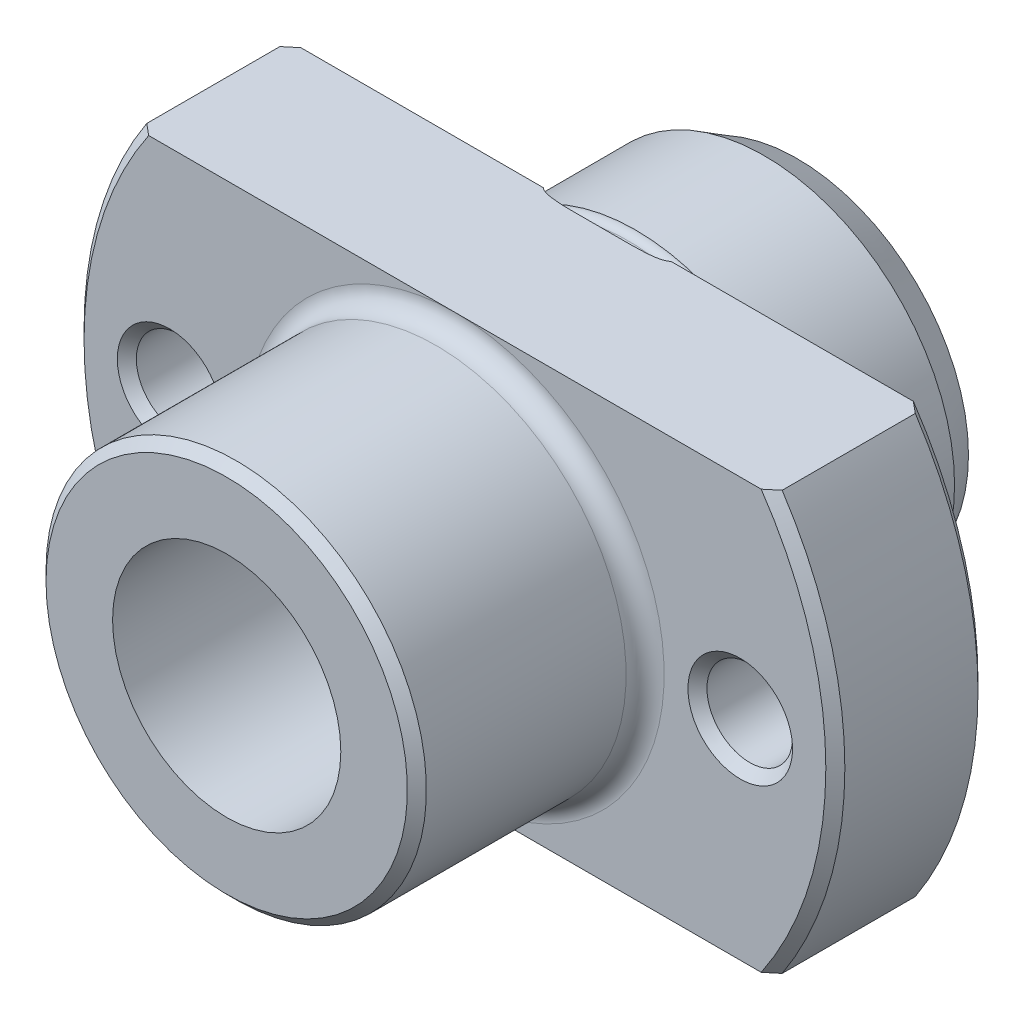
ISO-10303-21;
HEADER;
FILE_DESCRIPTION(('STEP AP214'),'2;1');
FILE_NAME('part.step','',(''),(''),'','','');
FILE_SCHEMA(('AUTOMOTIVE_DESIGN { 1 0 10303 214 1 1 1 1 }'));
ENDSEC;
DATA;
#1=APPLICATION_CONTEXT('core data for automotive mechanical design processes');
#2=APPLICATION_PROTOCOL_DEFINITION('international standard','automotive_design',2000,#1);
#3=PRODUCT_CONTEXT('',#1,'mechanical');
#4=PRODUCT('Part','Part','',(#3));
#5=PRODUCT_RELATED_PRODUCT_CATEGORY('part','',(#4));
#6=PRODUCT_DEFINITION_FORMATION('','',#4);
#7=PRODUCT_DEFINITION_CONTEXT('part definition',#1,'design');
#8=PRODUCT_DEFINITION('design','',#6,#7);
#9=PRODUCT_DEFINITION_SHAPE('','',#8);
#10=(LENGTH_UNIT() NAMED_UNIT(*) SI_UNIT(.MILLI.,.METRE.));
#11=(NAMED_UNIT(*) PLANE_ANGLE_UNIT() SI_UNIT($,.RADIAN.));
#12=(NAMED_UNIT(*) SI_UNIT($,.STERADIAN.) SOLID_ANGLE_UNIT());
#13=UNCERTAINTY_MEASURE_WITH_UNIT(LENGTH_MEASURE(1.E-05),#10,'distance_accuracy_value','');
#14=(GEOMETRIC_REPRESENTATION_CONTEXT(3) GLOBAL_UNCERTAINTY_ASSIGNED_CONTEXT((#13)) GLOBAL_UNIT_ASSIGNED_CONTEXT((#10,
#11,#12)) REPRESENTATION_CONTEXT('',''));
#15=CARTESIAN_POINT('',(0.,0.,0.));
#16=DIRECTION('',(0.,0.,1.));
#17=DIRECTION('',(1.,0.,0.));
#18=AXIS2_PLACEMENT_3D('',#15,#16,#17);
#19=CARTESIAN_POINT('',(10.,0.,0.));
#20=DIRECTION('',(0.,0.,1.));
#21=DIRECTION('',(1.,0.,0.));
#22=AXIS2_PLACEMENT_3D('',#19,#20,#21);
#23=PLANE('',#22);
#24=CARTESIAN_POINT('',(-15.,0.,0.));
#25=DIRECTION('',(0.,0.,1.));
#26=DIRECTION('',(1.,0.,0.));
#27=AXIS2_PLACEMENT_3D('',#24,#25,#26);
#28=CIRCLE('',#27,2.75);
#29=CARTESIAN_POINT('',(-12.25,0.,0.));
#30=VERTEX_POINT('',#29);
#31=EDGE_CURVE('E430',#30,#30,#28,.T.);
#32=ORIENTED_EDGE('',*,*,#31,.T.);
#33=EDGE_LOOP('',(#32));
#34=FACE_BOUND('',#33,.T.);
#35=DIRECTION('',(-1.,0.,0.));
#36=VECTOR('',#35,1.);
#37=CARTESIAN_POINT('',(10.,-11.,0.));
#38=LINE('',#37,#36);
#39=CARTESIAN_POINT('',(-3.35410196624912,-11.,1.42432074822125E-12));
#40=VERTEX_POINT('',#39);
#41=CARTESIAN_POINT('',(-16.1012421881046,-11.,0.));
#42=VERTEX_POINT('',#41);
#43=EDGE_CURVE('E373',#40,#42,#38,.T.);
#44=ORIENTED_EDGE('',*,*,#43,.T.);
#45=CARTESIAN_POINT('',(0.,0.,0.));
#46=DIRECTION('',(0.,0.,1.));
#47=DIRECTION('',(1.,0.,0.));
#48=AXIS2_PLACEMENT_3D('',#45,#46,#47);
#49=CIRCLE('',#48,19.5);
#50=CARTESIAN_POINT('',(-16.1012421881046,11.,0.));
#51=VERTEX_POINT('',#50);
#52=EDGE_CURVE('E117',#42,#51,#49,.F.);
#53=ORIENTED_EDGE('',*,*,#52,.T.);
#54=DIRECTION('',(1.,0.,0.));
#55=VECTOR('',#54,1.);
#56=CARTESIAN_POINT('',(10.,11.,0.));
#57=LINE('',#56,#55);
#58=CARTESIAN_POINT('',(-3.35410196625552,11.,-2.83689924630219E-12));
#59=VERTEX_POINT('',#58);
#60=EDGE_CURVE('E111',#51,#59,#57,.T.);
#61=ORIENTED_EDGE('',*,*,#60,.T.);
#62=CARTESIAN_POINT('',(0.,0.,0.));
#63=DIRECTION('',(0.,0.,1.));
#64=DIRECTION('',(1.,0.,0.));
#65=AXIS2_PLACEMENT_3D('',#62,#63,#64);
#66=CIRCLE('',#65,11.5);
#67=EDGE_CURVE('E115',#40,#59,#66,.F.);
#68=ORIENTED_EDGE('',*,*,#67,.F.);
#69=EDGE_LOOP('',(#44,#53,#61,#68));
#70=FACE_BOUND('',#69,.T.);
#71=ADVANCED_FACE('F14',(#34,#70),#23,.F.);
#72=CARTESIAN_POINT('',(11.,0.,8.));
#73=DIRECTION('',(0.,0.,-1.));
#74=DIRECTION('',(-1.,0.,0.));
#75=AXIS2_PLACEMENT_3D('',#72,#73,#74);
#76=PLANE('',#75);
#77=CARTESIAN_POINT('',(15.,0.,8.));
#78=DIRECTION('',(0.,0.,-1.));
#79=DIRECTION('',(-1.,0.,0.));
#80=AXIS2_PLACEMENT_3D('',#77,#78,#79);
#81=CIRCLE('',#80,2.75);
#82=CARTESIAN_POINT('',(12.25,0.,8.));
#83=VERTEX_POINT('',#82);
#84=EDGE_CURVE('E417',#83,#83,#81,.T.);
#85=ORIENTED_EDGE('',*,*,#84,.T.);
#86=EDGE_LOOP('',(#85));
#87=FACE_BOUND('',#86,.T.);
#88=DIRECTION('',(1.,0.,0.));
#89=VECTOR('',#88,1.);
#90=CARTESIAN_POINT('',(11.,-11.,8.));
#91=LINE('',#90,#89);
#92=CARTESIAN_POINT('',(0.,-11.,8.));
#93=VERTEX_POINT('',#92);
#94=CARTESIAN_POINT('',(16.1012421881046,-11.,8.));
#95=VERTEX_POINT('',#94);
#96=EDGE_CURVE('E374',#93,#95,#91,.T.);
#97=ORIENTED_EDGE('',*,*,#96,.T.);
#98=CARTESIAN_POINT('',(0.,0.,8.));
#99=DIRECTION('',(0.,0.,-1.));
#100=DIRECTION('',(-1.,0.,0.));
#101=AXIS2_PLACEMENT_3D('',#98,#99,#100);
#102=CIRCLE('',#101,19.5);
#103=CARTESIAN_POINT('',(16.1012421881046,11.,8.));
#104=VERTEX_POINT('',#103);
#105=EDGE_CURVE('E384',#95,#104,#102,.F.);
#106=ORIENTED_EDGE('',*,*,#105,.T.);
#107=DIRECTION('',(-1.,0.,0.));
#108=VECTOR('',#107,1.);
#109=CARTESIAN_POINT('',(11.,11.,8.));
#110=LINE('',#109,#108);
#111=CARTESIAN_POINT('',(0.,11.,8.));
#112=VERTEX_POINT('',#111);
#113=EDGE_CURVE('E364',#104,#112,#110,.T.);
#114=ORIENTED_EDGE('',*,*,#113,.T.);
#115=CARTESIAN_POINT('',(0.,0.,8.));
#116=DIRECTION('',(0.,0.,-1.));
#117=DIRECTION('',(-1.,0.,0.));
#118=AXIS2_PLACEMENT_3D('',#115,#116,#117);
#119=CIRCLE('',#118,11.);
#120=EDGE_CURVE('E285',#112,#93,#119,.T.);
#121=ORIENTED_EDGE('',*,*,#120,.T.);
#122=EDGE_LOOP('',(#97,#106,#114,#121));
#123=FACE_BOUND('',#122,.T.);
#124=ADVANCED_FACE('F313',(#87,#123),#76,.F.);
#125=CARTESIAN_POINT('',(0.,0.,-20.2470119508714));
#126=DIRECTION('',(0.,0.,-1.));
#127=DIRECTION('',(-1.,0.,0.));
#128=AXIS2_PLACEMENT_3D('',#125,#126,#127);
#129=CYLINDRICAL_SURFACE('',#128,20.);
#130=DIRECTION('',(0.,0.,1.));
#131=VECTOR('',#130,1.);
#132=CARTESIAN_POINT('',(-16.70329308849,11.,-10.));
#133=LINE('',#132,#131);
#134=CARTESIAN_POINT('',(-16.70329308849,11.,0.499999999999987));
#135=VERTEX_POINT('',#134);
#136=CARTESIAN_POINT('',(-16.70329308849,11.,7.5));
#137=VERTEX_POINT('',#136);
#138=EDGE_CURVE('E444',#135,#137,#133,.T.);
#139=ORIENTED_EDGE('',*,*,#138,.F.);
#140=CARTESIAN_POINT('',(0.,0.,0.499999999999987));
#141=DIRECTION('',(0.,0.,1.));
#142=DIRECTION('',(1.,0.,0.));
#143=AXIS2_PLACEMENT_3D('',#140,#141,#142);
#144=CIRCLE('',#143,20.);
#145=CARTESIAN_POINT('',(-16.70329308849,-11.,0.499999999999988));
#146=VERTEX_POINT('',#145);
#147=EDGE_CURVE('E253',#135,#146,#144,.T.);
#148=ORIENTED_EDGE('',*,*,#147,.T.);
#149=DIRECTION('',(0.,0.,1.));
#150=VECTOR('',#149,1.);
#151=CARTESIAN_POINT('',(-16.70329308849,-11.,-10.));
#152=LINE('',#151,#150);
#153=CARTESIAN_POINT('',(-16.70329308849,-11.,7.5));
#154=VERTEX_POINT('',#153);
#155=EDGE_CURVE('E363',#146,#154,#152,.T.);
#156=ORIENTED_EDGE('',*,*,#155,.T.);
#157=CARTESIAN_POINT('',(0.,0.,7.5));
#158=DIRECTION('',(0.,0.,-1.));
#159=DIRECTION('',(-1.,0.,0.));
#160=AXIS2_PLACEMENT_3D('',#157,#158,#159);
#161=CIRCLE('',#160,20.);
#162=EDGE_CURVE('E251',#154,#137,#161,.T.);
#163=ORIENTED_EDGE('',*,*,#162,.T.);
#164=EDGE_LOOP('',(#139,#148,#156,#163));
#165=FACE_BOUND('',#164,.T.);
#166=ADVANCED_FACE('F321',(#165),#129,.T.);
#167=CARTESIAN_POINT('',(0.,0.,-0.1));
#168=DIRECTION('',(0.,0.,1.));
#169=DIRECTION('',(1.,0.,0.));
#170=AXIS2_PLACEMENT_3D('',#167,#168,#169);
#171=TOROIDAL_SURFACE('',#170,11.1127016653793,0.4);
#172=CARTESIAN_POINT('',(0.,0.,0.3));
#173=DIRECTION('',(0.,0.,-1.));
#174=DIRECTION('',(-1.,0.,0.));
#175=AXIS2_PLACEMENT_3D('',#172,#173,#174);
#176=CIRCLE('',#175,11.1127016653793);
#177=CARTESIAN_POINT('',(1.57865078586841,11.,0.3));
#178=VERTEX_POINT('',#177);
#179=CARTESIAN_POINT('',(1.57865078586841,-11.,0.3));
#180=VERTEX_POINT('',#179);
#181=EDGE_CURVE('E148',#178,#180,#176,.T.);
#182=ORIENTED_EDGE('',*,*,#181,.F.);
#183=CARTESIAN_POINT('',(0.,11.,0.283794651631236));
#184=CARTESIAN_POINT('',(0.133380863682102,11.,0.283793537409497));
#185=CARTESIAN_POINT('',(0.266761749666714,11.,0.284532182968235));
#186=CARTESIAN_POINT('',(0.533429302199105,11.,0.287180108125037));
#187=CARTESIAN_POINT('',(0.666715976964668,11.,0.289088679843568));
#188=CARTESIAN_POINT('',(0.933009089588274,11.,0.293218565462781));
#189=CARTESIAN_POINT('',(1.06601553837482,11.,0.295439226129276));
#190=CARTESIAN_POINT('',(1.33209576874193,11.,0.298889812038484));
#191=CARTESIAN_POINT('',(1.46516955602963,11.,0.300119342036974));
#192=CARTESIAN_POINT('',(1.73215295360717,11.,0.299860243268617));
#193=CARTESIAN_POINT('',(1.86606267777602,11.,0.298354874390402));
#194=CARTESIAN_POINT('',(2.06674031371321,11.,0.292189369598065));
#195=CARTESIAN_POINT('',(2.13356494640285,11.,0.289485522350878));
#196=CARTESIAN_POINT('',(2.2671189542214,11.,0.282346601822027));
#197=CARTESIAN_POINT('',(2.33384833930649,11.,0.277911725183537));
#198=CARTESIAN_POINT('',(2.46792285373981,11.,0.266689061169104));
#199=CARTESIAN_POINT('',(2.53526572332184,11.,0.25987358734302));
#200=CARTESIAN_POINT('',(2.66975154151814,11.,0.24306163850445));
#201=CARTESIAN_POINT('',(2.73689356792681,11.,0.233057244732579));
#202=CARTESIAN_POINT('',(2.83669072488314,11.,0.214688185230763));
#203=CARTESIAN_POINT('',(2.86966098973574,11.,0.208041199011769));
#204=CARTESIAN_POINT('',(2.93528713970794,11.,0.193355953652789));
#205=CARTESIAN_POINT('',(2.96794310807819,11.,0.185318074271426));
#206=CARTESIAN_POINT('',(3.03264670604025,11.,0.16750644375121));
#207=CARTESIAN_POINT('',(3.06469621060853,11.,0.157739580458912));
#208=CARTESIAN_POINT('',(3.12797811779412,11.,0.135877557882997));
#209=CARTESIAN_POINT('',(3.15921156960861,11.,0.12378557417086));
#210=CARTESIAN_POINT('',(3.21336781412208,11.,0.099334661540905));
#211=CARTESIAN_POINT('',(3.23658799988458,11.,0.0876392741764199));
#212=CARTESIAN_POINT('',(3.28133570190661,11.,0.0614414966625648));
#213=CARTESIAN_POINT('',(3.30287251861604,11.,0.04695632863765));
#214=CARTESIAN_POINT('',(3.33013387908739,11.,0.0240690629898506));
#215=CARTESIAN_POINT('',(3.33736722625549,11.,0.0174810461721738));
#216=CARTESIAN_POINT('',(3.351124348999,11.,0.00356618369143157));
#217=CARTESIAN_POINT('',(3.35764688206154,11.,-0.00376191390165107));
#218=CARTESIAN_POINT('',(3.36973042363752,11.,-0.0193368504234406));
#219=CARTESIAN_POINT('',(3.37527843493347,11.,-0.0275940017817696));
#220=CARTESIAN_POINT('',(3.38481330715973,11.,-0.0449638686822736));
#221=CARTESIAN_POINT('',(3.38880571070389,11.,-0.0540734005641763));
#222=CARTESIAN_POINT('',(3.3937737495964,11.,-0.0700515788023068));
#223=CARTESIAN_POINT('',(3.39529947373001,11.,-0.0767482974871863));
#224=CARTESIAN_POINT('',(3.3971920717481,11.,-0.0903038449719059));
#225=CARTESIAN_POINT('',(3.39755984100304,11.,-0.0971625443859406));
#226=CARTESIAN_POINT('',(3.39709652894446,11.,-0.110840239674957));
#227=CARTESIAN_POINT('',(3.3962650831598,11.,-0.1176592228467));
#228=CARTESIAN_POINT('',(3.39349201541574,11.,-0.131067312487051));
#229=CARTESIAN_POINT('',(3.39154933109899,11.,-0.137656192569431));
#230=CARTESIAN_POINT('',(3.38587021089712,11.,-0.152743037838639));
#231=CARTESIAN_POINT('',(3.38174242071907,11.,-0.161092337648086));
#232=CARTESIAN_POINT('',(3.37222433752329,11.,-0.177033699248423));
#233=CARTESIAN_POINT('',(3.36683106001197,11.,-0.184623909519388));
#234=CARTESIAN_POINT('',(3.35096946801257,11.,-0.204275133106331));
#235=CARTESIAN_POINT('',(3.3396385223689,11.,-0.215631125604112));
#236=CARTESIAN_POINT('',(3.31551807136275,11.,-0.23664741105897));
#237=CARTESIAN_POINT('',(3.30272441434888,11.,-0.24630266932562));
#238=CARTESIAN_POINT('',(3.27062950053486,11.,-0.268132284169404));
#239=CARTESIAN_POINT('',(3.25087461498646,11.,-0.279631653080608));
#240=CARTESIAN_POINT('',(3.21036771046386,11.,-0.30074636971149));
#241=CARTESIAN_POINT('',(3.18961362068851,11.,-0.31035757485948));
#242=CARTESIAN_POINT('',(3.14739577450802,11.,-0.328188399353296));
#243=CARTESIAN_POINT('',(3.12592889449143,11.,-0.336400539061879));
#244=CARTESIAN_POINT('',(3.0826219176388,11.,-0.351673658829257));
#245=CARTESIAN_POINT('',(3.06078223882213,11.,-0.358735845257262));
#246=CARTESIAN_POINT('',(2.99872212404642,11.,-0.377383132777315));
#247=CARTESIAN_POINT('',(2.95818194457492,11.,-0.387901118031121));
#248=CARTESIAN_POINT('',(2.8765835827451,11.,-0.406720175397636));
#249=CARTESIAN_POINT('',(2.83552508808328,11.,-0.415019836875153));
#250=CARTESIAN_POINT('',(2.71172156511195,11.,-0.437407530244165));
#251=CARTESIAN_POINT('',(2.62851774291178,11.,-0.448939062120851));
#252=CARTESIAN_POINT('',(2.46153553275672,11.,-0.467607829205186));
#253=CARTESIAN_POINT('',(2.37775643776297,11.,-0.474737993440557));
#254=CARTESIAN_POINT('',(2.21010885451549,11.,-0.485890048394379));
#255=CARTESIAN_POINT('',(2.12624062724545,11.,-0.489915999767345));
#256=CARTESIAN_POINT('',(1.9583065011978,11.,-0.495789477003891));
#257=CARTESIAN_POINT('',(1.87424049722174,11.,-0.497633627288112));
#258=CARTESIAN_POINT('',(1.70608589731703,11.,-0.499800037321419));
#259=CARTESIAN_POINT('',(1.62199730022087,11.,-0.50012219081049));
#260=CARTESIAN_POINT('',(1.36963128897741,11.,-0.499632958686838));
#261=CARTESIAN_POINT('',(1.2013610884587,11.,-0.497363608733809));
#262=CARTESIAN_POINT('',(0.865368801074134,11.,-0.492242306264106));
#263=CARTESIAN_POINT('',(0.697646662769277,11.,-0.489392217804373));
#264=CARTESIAN_POINT('',(0.36223485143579,11.,-0.485233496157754));
#265=CARTESIAN_POINT('',(0.194545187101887,11.,-0.483924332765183));
#266=CARTESIAN_POINT('',(-0.140705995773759,11.,-0.483684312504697));
#267=CARTESIAN_POINT('',(-0.308267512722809,11.,-0.484751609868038));
#268=CARTESIAN_POINT('',(-0.643416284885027,11.,-0.488582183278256));
#269=CARTESIAN_POINT('',(-0.81100353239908,11.,-0.491345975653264));
#270=CARTESIAN_POINT('',(-1.14671590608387,11.,-0.496579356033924));
#271=CARTESIAN_POINT('',(-1.31484106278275,11.,-0.499047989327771));
#272=CARTESIAN_POINT('',(-1.56700647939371,11.,-0.500149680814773));
#273=CARTESIAN_POINT('',(-1.65103723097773,11.,-0.500083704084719));
#274=CARTESIAN_POINT('',(-1.81908376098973,11.,-0.498558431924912));
#275=CARTESIAN_POINT('',(-1.9030995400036,11.,-0.497099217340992));
#276=CARTESIAN_POINT('',(-2.07153535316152,11.,-0.492143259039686));
#277=CARTESIAN_POINT('',(-2.15595510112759,11.,-0.488635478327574));
#278=CARTESIAN_POINT('',(-2.3247103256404,11.,-0.478707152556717));
#279=CARTESIAN_POINT('',(-2.4090456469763,11.,-0.472283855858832));
#280=CARTESIAN_POINT('',(-2.5771075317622,11.,-0.455317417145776));
#281=CARTESIAN_POINT('',(-2.66083513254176,11.,-0.444785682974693));
#282=CARTESIAN_POINT('',(-2.78560453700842,11.,-0.424308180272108));
#283=CARTESIAN_POINT('',(-2.82702665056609,11.,-0.416709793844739));
#284=CARTESIAN_POINT('',(-2.90944333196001,11.,-0.399495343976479));
#285=CARTESIAN_POINT('',(-2.95043802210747,11.,-0.389879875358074));
#286=CARTESIAN_POINT('',(-3.03193070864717,11.,-0.367909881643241));
#287=CARTESIAN_POINT('',(-3.07242539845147,11.,-0.355542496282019));
#288=CARTESIAN_POINT('',(-3.1320282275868,11.,-0.334069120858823));
#289=CARTESIAN_POINT('',(-3.1516637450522,11.,-0.326444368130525));
#290=CARTESIAN_POINT('',(-3.19040309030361,11.,-0.309957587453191));
#291=CARTESIAN_POINT('',(-3.20950697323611,11.,-0.301095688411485));
#292=CARTESIAN_POINT('',(-3.25303790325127,11.,-0.278623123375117));
#293=CARTESIAN_POINT('',(-3.27717518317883,11.,-0.264405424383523));
#294=CARTESIAN_POINT('',(-3.31404453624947,11.,-0.237813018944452));
#295=CARTESIAN_POINT('',(-3.32768396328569,11.,-0.226713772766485));
#296=CARTESIAN_POINT('',(-3.35279396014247,11.,-0.202281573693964));
#297=CARTESIAN_POINT('',(-3.36427949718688,11.,-0.188965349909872));
#298=CARTESIAN_POINT('',(-3.37780282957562,11.,-0.167982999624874));
#299=CARTESIAN_POINT('',(-3.38150318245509,11.,-0.161399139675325));
#300=CARTESIAN_POINT('',(-3.38789364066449,11.,-0.147752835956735));
#301=CARTESIAN_POINT('',(-3.39058456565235,11.,-0.140690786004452));
#302=CARTESIAN_POINT('',(-3.39472985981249,11.,-0.126124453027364));
#303=CARTESIAN_POINT('',(-3.39617134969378,11.,-0.118616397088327));
#304=CARTESIAN_POINT('',(-3.39758788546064,11.,-0.10346326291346));
#305=CARTESIAN_POINT('',(-3.397563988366,11.,-0.0958182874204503));
#306=CARTESIAN_POINT('',(-3.3961370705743,11.,-0.0814758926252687));
#307=CARTESIAN_POINT('',(-3.39487908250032,11.,-0.0747632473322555));
#308=CARTESIAN_POINT('',(-3.39132322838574,11.,-0.0616210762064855));
#309=CARTESIAN_POINT('',(-3.38902457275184,11.,-0.0551917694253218));
#310=CARTESIAN_POINT('',(-3.38231690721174,11.,-0.0398529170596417));
#311=CARTESIAN_POINT('',(-3.37742352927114,11.,-0.0311568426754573));
#312=CARTESIAN_POINT('',(-3.3663490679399,11.,-0.0146304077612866));
#313=CARTESIAN_POINT('',(-3.36016452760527,11.,-0.00680245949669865));
#314=CARTESIAN_POINT('',(-3.34166029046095,11.,0.0139658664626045));
#315=CARTESIAN_POINT('',(-3.32836883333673,11.,0.0260293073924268));
#316=CARTESIAN_POINT('',(-3.30028411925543,11.,0.0482270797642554));
#317=CARTESIAN_POINT('',(-3.28548654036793,11.,0.0583556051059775));
#318=CARTESIAN_POINT('',(-3.24743635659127,11.,0.0818322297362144));
#319=CARTESIAN_POINT('',(-3.22363489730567,11.,0.0942806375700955));
#320=CARTESIAN_POINT('',(-3.17497661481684,11.,0.116948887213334));
#321=CARTESIAN_POINT('',(-3.15011751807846,11.,0.127163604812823));
#322=CARTESIAN_POINT('',(-3.09965297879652,11.,0.14596873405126));
#323=CARTESIAN_POINT('',(-3.07404434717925,11.,0.154550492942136));
#324=CARTESIAN_POINT('',(-3.02246039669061,11.,0.170389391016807));
#325=CARTESIAN_POINT('',(-2.99648552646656,11.,0.177648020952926));
#326=CARTESIAN_POINT('',(-2.91972480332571,11.,0.197448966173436));
#327=CARTESIAN_POINT('',(-2.86856705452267,11.,0.208544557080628));
#328=CARTESIAN_POINT('',(-2.76571913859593,11.,0.227963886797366));
#329=CARTESIAN_POINT('',(-2.71402863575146,11.,0.236285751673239));
#330=CARTESIAN_POINT('',(-2.61024124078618,11.,0.250843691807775));
#331=CARTESIAN_POINT('',(-2.55814369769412,11.,0.257075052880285));
#332=CARTESIAN_POINT('',(-2.45377521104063,11.,0.26788960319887));
#333=CARTESIAN_POINT('',(-2.40150424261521,11.,0.272472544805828));
#334=CARTESIAN_POINT('',(-2.24444868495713,11.,0.284275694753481));
#335=CARTESIAN_POINT('',(-2.13951884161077,11.,0.289538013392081));
#336=CARTESIAN_POINT('',(-1.92970384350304,11.,0.296697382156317));
#337=CARTESIAN_POINT('',(-1.82481880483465,11.,0.298598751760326));
#338=CARTESIAN_POINT('',(-1.57649986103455,11.,0.300616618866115));
#339=CARTESIAN_POINT('',(-1.43306088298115,11.,0.299820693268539));
#340=CARTESIAN_POINT('',(-1.14615095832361,11.,0.296681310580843));
#341=CARTESIAN_POINT('',(-1.00268002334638,11.,0.294337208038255));
#342=CARTESIAN_POINT('',(-0.716005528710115,11.,0.289830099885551));
#343=CARTESIAN_POINT('',(-0.572801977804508,11.,0.287666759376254));
#344=CARTESIAN_POINT('',(-0.286398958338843,11.,0.284649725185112));
#345=CARTESIAN_POINT('',(-0.14319949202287,11.,0.283795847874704));
#346=CARTESIAN_POINT('',(0.,11.,0.283794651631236));
#347=B_SPLINE_CURVE_WITH_KNOTS('',3,(#183,#184,#185,#186,#187,#188,#189,#190,#191,#192,#193,
#194,#195,#196,#197,#198,#199,#200,#201,#202,#203,#204,#205,#206,#207,#208,#209,#210,#211,#212,
#213,#214,#215,#216,#217,#218,#219,#220,#221,#222,#223,#224,#225,#226,#227,#228,#229,#230,#231,
#232,#233,#234,#235,#236,#237,#238,#239,#240,#241,#242,#243,#244,#245,#246,#247,#248,#249,#250,
#251,#252,#253,#254,#255,#256,#257,#258,#259,#260,#261,#262,#263,#264,#265,#266,#267,#268,#269,
#270,#271,#272,#273,#274,#275,#276,#277,#278,#279,#280,#281,#282,#283,#284,#285,#286,#287,#288,
#289,#290,#291,#292,#293,#294,#295,#296,#297,#298,#299,#300,#301,#302,#303,#304,#305,#306,#307,
#308,#309,#310,#311,#312,#313,#314,#315,#316,#317,#318,#319,#320,#321,#322,#323,#324,#325,#326,
#327,#328,#329,#330,#331,#332,#333,#334,#335,#336,#337,#338,#339,#340,#341,#342,#343,#344,#345,
#346),.UNSPECIFIED.,.T.,.F.,(4,2,2,2,2,2,2,2,2,2,2,2,2,2,2,2,2,2,2,2,2,2,2,2,2,2,2,2,2,2,2,2,2,
2,2,2,2,2,2,2,2,2,2,2,2,2,2,2,2,2,2,2,2,2,2,2,2,2,2,2,2,2,2,2,2,2,2,2,2,2,2,2,2,2,2,2,2,2,2,2,2,
4),(0.,0.400141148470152,0.800040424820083,1.19911480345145,1.59834824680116,2.00003360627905,
2.20065541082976,2.40125443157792,2.6042686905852,2.80779105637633,2.90867005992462,
3.00952156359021,3.10997998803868,3.21030217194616,3.2882048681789,3.36564123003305,
3.39495326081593,3.42431573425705,3.45404416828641,3.48366568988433,3.5041817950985,
3.52468203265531,3.54518850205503,3.56571460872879,3.59349793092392,3.62134744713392,
3.66920210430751,3.71719612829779,3.78560130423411,3.85415492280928,3.92306426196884,
3.99190083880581,4.11744852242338,4.24307585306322,4.49485418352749,4.74703596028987,
4.99888729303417,5.25112777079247,5.50338585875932,6.0082242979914,6.51146713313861,
7.01453676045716,7.51721579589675,8.02004789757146,8.5244647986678,8.77654926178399,
9.02861909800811,9.28205969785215,9.53573999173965,9.78872085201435,9.91502240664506,
10.0412867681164,10.1681540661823,10.2313086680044,10.2944566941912,10.3781451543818,
10.4307633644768,10.4830011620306,10.505593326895,10.5281671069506,10.5509709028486,
10.5737582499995,10.5941535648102,10.614564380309,10.6443280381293,10.6741724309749,
10.7277181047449,10.7814220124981,10.8618009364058,10.9423623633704,11.0233394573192,
11.1042247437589,11.2611389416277,11.4181589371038,11.5755306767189,11.7329260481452,
12.0480108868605,12.3626904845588,12.792984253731,13.2234575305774,13.6531147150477,
14.0827116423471),.UNSPECIFIED.);
#348=CARTESIAN_POINT('',(3.35410196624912,11.,1.42432074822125E-12));
#349=VERTEX_POINT('',#348);
#350=EDGE_CURVE('E129',#178,#349,#347,.T.);
#351=ORIENTED_EDGE('',*,*,#350,.T.);
#352=CARTESIAN_POINT('',(3.35410196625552,-11.,-2.83689924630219E-12));
#353=VERTEX_POINT('',#352);
#354=EDGE_CURVE('E135',#349,#353,#66,.F.);
#355=ORIENTED_EDGE('',*,*,#354,.T.);
#356=CARTESIAN_POINT('',(0.,-11.,0.283794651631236));
#357=CARTESIAN_POINT('',(-0.133380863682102,-11.,0.283793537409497));
#358=CARTESIAN_POINT('',(-0.266761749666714,-11.,0.284532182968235));
#359=CARTESIAN_POINT('',(-0.533429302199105,-11.,0.287180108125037));
#360=CARTESIAN_POINT('',(-0.666715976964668,-11.,0.289088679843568));
#361=CARTESIAN_POINT('',(-0.933009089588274,-11.,0.293218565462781));
#362=CARTESIAN_POINT('',(-1.06601553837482,-11.,0.295439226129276));
#363=CARTESIAN_POINT('',(-1.33209576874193,-11.,0.298889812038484));
#364=CARTESIAN_POINT('',(-1.46516955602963,-11.,0.300119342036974));
#365=CARTESIAN_POINT('',(-1.73215295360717,-11.,0.299860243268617));
#366=CARTESIAN_POINT('',(-1.86606267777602,-11.,0.298354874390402));
#367=CARTESIAN_POINT('',(-2.06674031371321,-11.,0.292189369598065));
#368=CARTESIAN_POINT('',(-2.13356494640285,-11.,0.289485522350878));
#369=CARTESIAN_POINT('',(-2.2671189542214,-11.,0.282346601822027));
#370=CARTESIAN_POINT('',(-2.33384833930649,-11.,0.277911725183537));
#371=CARTESIAN_POINT('',(-2.46792285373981,-11.,0.266689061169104));
#372=CARTESIAN_POINT('',(-2.53526572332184,-11.,0.25987358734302));
#373=CARTESIAN_POINT('',(-2.66975154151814,-11.,0.24306163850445));
#374=CARTESIAN_POINT('',(-2.73689356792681,-11.,0.233057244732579));
#375=CARTESIAN_POINT('',(-2.83669072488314,-11.,0.214688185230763));
#376=CARTESIAN_POINT('',(-2.86966098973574,-11.,0.208041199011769));
#377=CARTESIAN_POINT('',(-2.93528713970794,-11.,0.193355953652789));
#378=CARTESIAN_POINT('',(-2.96794310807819,-11.,0.185318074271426));
#379=CARTESIAN_POINT('',(-3.03264670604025,-11.,0.16750644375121));
#380=CARTESIAN_POINT('',(-3.06469621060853,-11.,0.157739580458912));
#381=CARTESIAN_POINT('',(-3.12797811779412,-11.,0.135877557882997));
#382=CARTESIAN_POINT('',(-3.15921156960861,-11.,0.12378557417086));
#383=CARTESIAN_POINT('',(-3.21336781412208,-11.,0.099334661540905));
#384=CARTESIAN_POINT('',(-3.23658799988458,-11.,0.0876392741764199));
#385=CARTESIAN_POINT('',(-3.28133570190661,-11.,0.0614414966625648));
#386=CARTESIAN_POINT('',(-3.30287251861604,-11.,0.04695632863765));
#387=CARTESIAN_POINT('',(-3.33013387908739,-11.,0.0240690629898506));
#388=CARTESIAN_POINT('',(-3.33736722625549,-11.,0.0174810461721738));
#389=CARTESIAN_POINT('',(-3.351124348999,-11.,0.00356618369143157));
#390=CARTESIAN_POINT('',(-3.35764688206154,-11.,-0.00376191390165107));
#391=CARTESIAN_POINT('',(-3.36973042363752,-11.,-0.0193368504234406));
#392=CARTESIAN_POINT('',(-3.37527843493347,-11.,-0.0275940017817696));
#393=CARTESIAN_POINT('',(-3.38481330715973,-11.,-0.0449638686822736));
#394=CARTESIAN_POINT('',(-3.38880571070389,-11.,-0.0540734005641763));
#395=CARTESIAN_POINT('',(-3.3937737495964,-11.,-0.0700515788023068));
#396=CARTESIAN_POINT('',(-3.39529947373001,-11.,-0.0767482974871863));
#397=CARTESIAN_POINT('',(-3.3971920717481,-11.,-0.0903038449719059));
#398=CARTESIAN_POINT('',(-3.39755984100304,-11.,-0.0971625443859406));
#399=CARTESIAN_POINT('',(-3.39709652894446,-11.,-0.110840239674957));
#400=CARTESIAN_POINT('',(-3.3962650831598,-11.,-0.1176592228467));
#401=CARTESIAN_POINT('',(-3.39349201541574,-11.,-0.131067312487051));
#402=CARTESIAN_POINT('',(-3.39154933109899,-11.,-0.137656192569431));
#403=CARTESIAN_POINT('',(-3.38587021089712,-11.,-0.152743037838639));
#404=CARTESIAN_POINT('',(-3.38174242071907,-11.,-0.161092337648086));
#405=CARTESIAN_POINT('',(-3.37222433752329,-11.,-0.177033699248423));
#406=CARTESIAN_POINT('',(-3.36683106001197,-11.,-0.184623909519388));
#407=CARTESIAN_POINT('',(-3.35096946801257,-11.,-0.204275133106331));
#408=CARTESIAN_POINT('',(-3.3396385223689,-11.,-0.215631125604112));
#409=CARTESIAN_POINT('',(-3.31551807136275,-11.,-0.23664741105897));
#410=CARTESIAN_POINT('',(-3.30272441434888,-11.,-0.24630266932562));
#411=CARTESIAN_POINT('',(-3.27062950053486,-11.,-0.268132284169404));
#412=CARTESIAN_POINT('',(-3.25087461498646,-11.,-0.279631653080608));
#413=CARTESIAN_POINT('',(-3.21036771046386,-11.,-0.30074636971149));
#414=CARTESIAN_POINT('',(-3.18961362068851,-11.,-0.31035757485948));
#415=CARTESIAN_POINT('',(-3.14739577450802,-11.,-0.328188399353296));
#416=CARTESIAN_POINT('',(-3.12592889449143,-11.,-0.336400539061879));
#417=CARTESIAN_POINT('',(-3.0826219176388,-11.,-0.351673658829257));
#418=CARTESIAN_POINT('',(-3.06078223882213,-11.,-0.358735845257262));
#419=CARTESIAN_POINT('',(-2.99872212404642,-11.,-0.377383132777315));
#420=CARTESIAN_POINT('',(-2.95818194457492,-11.,-0.387901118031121));
#421=CARTESIAN_POINT('',(-2.8765835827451,-11.,-0.406720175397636));
#422=CARTESIAN_POINT('',(-2.83552508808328,-11.,-0.415019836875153));
#423=CARTESIAN_POINT('',(-2.71172156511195,-11.,-0.437407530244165));
#424=CARTESIAN_POINT('',(-2.62851774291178,-11.,-0.448939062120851));
#425=CARTESIAN_POINT('',(-2.46153553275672,-11.,-0.467607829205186));
#426=CARTESIAN_POINT('',(-2.37775643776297,-11.,-0.474737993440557));
#427=CARTESIAN_POINT('',(-2.21010885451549,-11.,-0.485890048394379));
#428=CARTESIAN_POINT('',(-2.12624062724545,-11.,-0.489915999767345));
#429=CARTESIAN_POINT('',(-1.9583065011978,-11.,-0.495789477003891));
#430=CARTESIAN_POINT('',(-1.87424049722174,-11.,-0.497633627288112));
#431=CARTESIAN_POINT('',(-1.70608589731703,-11.,-0.499800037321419));
#432=CARTESIAN_POINT('',(-1.62199730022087,-11.,-0.50012219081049));
#433=CARTESIAN_POINT('',(-1.36963128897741,-11.,-0.499632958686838));
#434=CARTESIAN_POINT('',(-1.2013610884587,-11.,-0.497363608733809));
#435=CARTESIAN_POINT('',(-0.865368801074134,-11.,-0.492242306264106));
#436=CARTESIAN_POINT('',(-0.697646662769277,-11.,-0.489392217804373));
#437=CARTESIAN_POINT('',(-0.36223485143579,-11.,-0.485233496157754));
#438=CARTESIAN_POINT('',(-0.194545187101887,-11.,-0.483924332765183));
#439=CARTESIAN_POINT('',(0.140705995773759,-11.,-0.483684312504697));
#440=CARTESIAN_POINT('',(0.308267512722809,-11.,-0.484751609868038));
#441=CARTESIAN_POINT('',(0.643416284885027,-11.,-0.488582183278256));
#442=CARTESIAN_POINT('',(0.81100353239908,-11.,-0.491345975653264));
#443=CARTESIAN_POINT('',(1.14671590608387,-11.,-0.496579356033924));
#444=CARTESIAN_POINT('',(1.31484106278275,-11.,-0.499047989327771));
#445=CARTESIAN_POINT('',(1.56700647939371,-11.,-0.500149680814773));
#446=CARTESIAN_POINT('',(1.65103723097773,-11.,-0.500083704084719));
#447=CARTESIAN_POINT('',(1.81908376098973,-11.,-0.498558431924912));
#448=CARTESIAN_POINT('',(1.9030995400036,-11.,-0.497099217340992));
#449=CARTESIAN_POINT('',(2.07153535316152,-11.,-0.492143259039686));
#450=CARTESIAN_POINT('',(2.15595510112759,-11.,-0.488635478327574));
#451=CARTESIAN_POINT('',(2.3247103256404,-11.,-0.478707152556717));
#452=CARTESIAN_POINT('',(2.4090456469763,-11.,-0.472283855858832));
#453=CARTESIAN_POINT('',(2.5771075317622,-11.,-0.455317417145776));
#454=CARTESIAN_POINT('',(2.66083513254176,-11.,-0.444785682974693));
#455=CARTESIAN_POINT('',(2.78560453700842,-11.,-0.424308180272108));
#456=CARTESIAN_POINT('',(2.82702665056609,-11.,-0.416709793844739));
#457=CARTESIAN_POINT('',(2.90944333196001,-11.,-0.399495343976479));
#458=CARTESIAN_POINT('',(2.95043802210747,-11.,-0.389879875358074));
#459=CARTESIAN_POINT('',(3.03193070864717,-11.,-0.367909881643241));
#460=CARTESIAN_POINT('',(3.07242539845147,-11.,-0.355542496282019));
#461=CARTESIAN_POINT('',(3.1320282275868,-11.,-0.334069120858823));
#462=CARTESIAN_POINT('',(3.1516637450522,-11.,-0.326444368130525));
#463=CARTESIAN_POINT('',(3.19040309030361,-11.,-0.309957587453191));
#464=CARTESIAN_POINT('',(3.20950697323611,-11.,-0.301095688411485));
#465=CARTESIAN_POINT('',(3.25303790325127,-11.,-0.278623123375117));
#466=CARTESIAN_POINT('',(3.27717518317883,-11.,-0.264405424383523));
#467=CARTESIAN_POINT('',(3.31404453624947,-11.,-0.237813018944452));
#468=CARTESIAN_POINT('',(3.32768396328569,-11.,-0.226713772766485));
#469=CARTESIAN_POINT('',(3.35279396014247,-11.,-0.202281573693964));
#470=CARTESIAN_POINT('',(3.36427949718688,-11.,-0.188965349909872));
#471=CARTESIAN_POINT('',(3.37780282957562,-11.,-0.167982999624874));
#472=CARTESIAN_POINT('',(3.38150318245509,-11.,-0.161399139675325));
#473=CARTESIAN_POINT('',(3.38789364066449,-11.,-0.147752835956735));
#474=CARTESIAN_POINT('',(3.39058456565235,-11.,-0.140690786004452));
#475=CARTESIAN_POINT('',(3.39472985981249,-11.,-0.126124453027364));
#476=CARTESIAN_POINT('',(3.39617134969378,-11.,-0.118616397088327));
#477=CARTESIAN_POINT('',(3.39758788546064,-11.,-0.10346326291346));
#478=CARTESIAN_POINT('',(3.397563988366,-11.,-0.0958182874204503));
#479=CARTESIAN_POINT('',(3.3961370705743,-11.,-0.0814758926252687));
#480=CARTESIAN_POINT('',(3.39487908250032,-11.,-0.0747632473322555));
#481=CARTESIAN_POINT('',(3.39132322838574,-11.,-0.0616210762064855));
#482=CARTESIAN_POINT('',(3.38902457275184,-11.,-0.0551917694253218));
#483=CARTESIAN_POINT('',(3.38231690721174,-11.,-0.0398529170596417));
#484=CARTESIAN_POINT('',(3.37742352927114,-11.,-0.0311568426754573));
#485=CARTESIAN_POINT('',(3.3663490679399,-11.,-0.0146304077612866));
#486=CARTESIAN_POINT('',(3.36016452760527,-11.,-0.00680245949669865));
#487=CARTESIAN_POINT('',(3.34166029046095,-11.,0.0139658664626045));
#488=CARTESIAN_POINT('',(3.32836883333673,-11.,0.0260293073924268));
#489=CARTESIAN_POINT('',(3.30028411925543,-11.,0.0482270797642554));
#490=CARTESIAN_POINT('',(3.28548654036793,-11.,0.0583556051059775));
#491=CARTESIAN_POINT('',(3.24743635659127,-11.,0.0818322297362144));
#492=CARTESIAN_POINT('',(3.22363489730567,-11.,0.0942806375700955));
#493=CARTESIAN_POINT('',(3.17497661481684,-11.,0.116948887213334));
#494=CARTESIAN_POINT('',(3.15011751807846,-11.,0.127163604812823));
#495=CARTESIAN_POINT('',(3.09965297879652,-11.,0.14596873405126));
#496=CARTESIAN_POINT('',(3.07404434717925,-11.,0.154550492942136));
#497=CARTESIAN_POINT('',(3.02246039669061,-11.,0.170389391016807));
#498=CARTESIAN_POINT('',(2.99648552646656,-11.,0.177648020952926));
#499=CARTESIAN_POINT('',(2.91972480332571,-11.,0.197448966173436));
#500=CARTESIAN_POINT('',(2.86856705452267,-11.,0.208544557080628));
#501=CARTESIAN_POINT('',(2.76571913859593,-11.,0.227963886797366));
#502=CARTESIAN_POINT('',(2.71402863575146,-11.,0.236285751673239));
#503=CARTESIAN_POINT('',(2.61024124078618,-11.,0.250843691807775));
#504=CARTESIAN_POINT('',(2.55814369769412,-11.,0.257075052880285));
#505=CARTESIAN_POINT('',(2.45377521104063,-11.,0.26788960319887));
#506=CARTESIAN_POINT('',(2.40150424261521,-11.,0.272472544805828));
#507=CARTESIAN_POINT('',(2.24444868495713,-11.,0.284275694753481));
#508=CARTESIAN_POINT('',(2.13951884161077,-11.,0.289538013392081));
#509=CARTESIAN_POINT('',(1.92970384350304,-11.,0.296697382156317));
#510=CARTESIAN_POINT('',(1.82481880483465,-11.,0.298598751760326));
#511=CARTESIAN_POINT('',(1.57649986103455,-11.,0.300616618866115));
#512=CARTESIAN_POINT('',(1.43306088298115,-11.,0.299820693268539));
#513=CARTESIAN_POINT('',(1.14615095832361,-11.,0.296681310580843));
#514=CARTESIAN_POINT('',(1.00268002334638,-11.,0.294337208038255));
#515=CARTESIAN_POINT('',(0.716005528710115,-11.,0.289830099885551));
#516=CARTESIAN_POINT('',(0.572801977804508,-11.,0.287666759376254));
#517=CARTESIAN_POINT('',(0.286398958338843,-11.,0.284649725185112));
#518=CARTESIAN_POINT('',(0.14319949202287,-11.,0.283795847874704));
#519=CARTESIAN_POINT('',(0.,-11.,0.283794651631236));
#520=B_SPLINE_CURVE_WITH_KNOTS('',3,(#356,#357,#358,#359,#360,#361,#362,#363,#364,#365,#366,
#367,#368,#369,#370,#371,#372,#373,#374,#375,#376,#377,#378,#379,#380,#381,#382,#383,#384,#385,
#386,#387,#388,#389,#390,#391,#392,#393,#394,#395,#396,#397,#398,#399,#400,#401,#402,#403,#404,
#405,#406,#407,#408,#409,#410,#411,#412,#413,#414,#415,#416,#417,#418,#419,#420,#421,#422,#423,
#424,#425,#426,#427,#428,#429,#430,#431,#432,#433,#434,#435,#436,#437,#438,#439,#440,#441,#442,
#443,#444,#445,#446,#447,#448,#449,#450,#451,#452,#453,#454,#455,#456,#457,#458,#459,#460,#461,
#462,#463,#464,#465,#466,#467,#468,#469,#470,#471,#472,#473,#474,#475,#476,#477,#478,#479,#480,
#481,#482,#483,#484,#485,#486,#487,#488,#489,#490,#491,#492,#493,#494,#495,#496,#497,#498,#499,
#500,#501,#502,#503,#504,#505,#506,#507,#508,#509,#510,#511,#512,#513,#514,#515,#516,#517,#518,
#519),.UNSPECIFIED.,.T.,.F.,(4,2,2,2,2,2,2,2,2,2,2,2,2,2,2,2,2,2,2,2,2,2,2,2,2,2,2,2,2,2,2,2,2,
2,2,2,2,2,2,2,2,2,2,2,2,2,2,2,2,2,2,2,2,2,2,2,2,2,2,2,2,2,2,2,2,2,2,2,2,2,2,2,2,2,2,2,2,2,2,2,2,
4),(0.,0.400141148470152,0.800040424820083,1.19911480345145,1.59834824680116,2.00003360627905,
2.20065541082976,2.40125443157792,2.6042686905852,2.80779105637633,2.90867005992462,
3.00952156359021,3.10997998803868,3.21030217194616,3.2882048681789,3.36564123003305,
3.39495326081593,3.42431573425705,3.45404416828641,3.48366568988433,3.5041817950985,
3.52468203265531,3.54518850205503,3.56571460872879,3.59349793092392,3.62134744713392,
3.66920210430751,3.71719612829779,3.78560130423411,3.85415492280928,3.92306426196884,
3.99190083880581,4.11744852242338,4.24307585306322,4.49485418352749,4.74703596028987,
4.99888729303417,5.25112777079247,5.50338585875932,6.0082242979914,6.51146713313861,
7.01453676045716,7.51721579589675,8.02004789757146,8.5244647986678,8.77654926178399,
9.02861909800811,9.28205969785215,9.53573999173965,9.78872085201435,9.91502240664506,
10.0412867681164,10.1681540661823,10.2313086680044,10.2944566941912,10.3781451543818,
10.4307633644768,10.4830011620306,10.505593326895,10.5281671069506,10.5509709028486,
10.5737582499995,10.5941535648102,10.614564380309,10.6443280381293,10.6741724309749,
10.7277181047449,10.7814220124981,10.8618009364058,10.9423623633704,11.0233394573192,
11.1042247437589,11.2611389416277,11.4181589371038,11.5755306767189,11.7329260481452,
12.0480108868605,12.3626904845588,12.792984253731,13.2234575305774,13.6531147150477,
14.0827116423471),.UNSPECIFIED.);
#521=EDGE_CURVE('E158',#353,#180,#520,.T.);
#522=ORIENTED_EDGE('',*,*,#521,.T.);
#523=EDGE_LOOP('',(#182,#351,#355,#522));
#524=FACE_BOUND('',#523,.T.);
#525=ADVANCED_FACE('F329',(#524),#171,.F.);
#526=CARTESIAN_POINT('',(15.,0.,0.));
#527=DIRECTION('',(0.,0.,1.));
#528=DIRECTION('',(1.,0.,0.));
#529=AXIS2_PLACEMENT_3D('',#526,#527,#528);
#530=CIRCLE('',#529,2.75);
#531=CARTESIAN_POINT('',(17.75,0.,0.));
#532=VERTEX_POINT('',#531);
#533=EDGE_CURVE('E341',#532,#532,#530,.T.);
#534=ORIENTED_EDGE('',*,*,#533,.T.);
#535=EDGE_LOOP('',(#534));
#536=FACE_BOUND('',#535,.T.);
#537=CARTESIAN_POINT('',(16.1012421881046,11.,0.));
#538=VERTEX_POINT('',#537);
#539=EDGE_CURVE('E118',#349,#538,#57,.T.);
#540=ORIENTED_EDGE('',*,*,#539,.T.);
#541=CARTESIAN_POINT('',(0.,0.,0.));
#542=DIRECTION('',(0.,0.,1.));
#543=DIRECTION('',(1.,0.,0.));
#544=AXIS2_PLACEMENT_3D('',#541,#542,#543);
#545=CIRCLE('',#544,19.5);
#546=CARTESIAN_POINT('',(16.1012421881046,-11.,0.));
#547=VERTEX_POINT('',#546);
#548=EDGE_CURVE('E247',#538,#547,#545,.F.);
#549=ORIENTED_EDGE('',*,*,#548,.T.);
#550=EDGE_CURVE('E355',#547,#353,#38,.T.);
#551=ORIENTED_EDGE('',*,*,#550,.T.);
#552=ORIENTED_EDGE('',*,*,#354,.F.);
#553=EDGE_LOOP('',(#540,#549,#551,#552));
#554=FACE_BOUND('',#553,.T.);
#555=ADVANCED_FACE('F316',(#536,#554),#23,.F.);
#556=CARTESIAN_POINT('',(0.,0.,-20.2470119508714));
#557=DIRECTION('',(0.,0.,-1.));
#558=DIRECTION('',(-1.,0.,0.));
#559=AXIS2_PLACEMENT_3D('',#556,#557,#558);
#560=CYLINDRICAL_SURFACE('',#559,10.);
#561=CARTESIAN_POINT('',(0.,0.,-8.26794919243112));
#562=DIRECTION('',(0.,0.,1.));
#563=DIRECTION('',(1.,0.,0.));
#564=AXIS2_PLACEMENT_3D('',#561,#562,#563);
#565=CIRCLE('',#564,10.);
#566=CARTESIAN_POINT('',(10.,0.,-8.26794919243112));
#567=VERTEX_POINT('',#566);
#568=EDGE_CURVE('E411',#567,#567,#565,.T.);
#569=ORIENTED_EDGE('',*,*,#568,.T.);
#570=EDGE_LOOP('',(#569));
#571=FACE_BOUND('',#570,.T.);
#572=CARTESIAN_POINT('',(0.,0.,-1.5));
#573=DIRECTION('',(0.,0.,1.));
#574=DIRECTION('',(1.,0.,0.));
#575=AXIS2_PLACEMENT_3D('',#572,#573,#574);
#576=CIRCLE('',#575,10.);
#577=CARTESIAN_POINT('',(10.,0.,-1.5));
#578=VERTEX_POINT('',#577);
#579=EDGE_CURVE('E141',#578,#578,#576,.T.);
#580=ORIENTED_EDGE('',*,*,#579,.F.);
#581=EDGE_LOOP('',(#580));
#582=FACE_BOUND('',#581,.T.);
#583=ADVANCED_FACE('F273',(#571,#582),#560,.T.);
#584=CARTESIAN_POINT('',(4.2,0.,-8.5));
#585=DIRECTION('',(0.,0.,-1.));
#586=DIRECTION('',(-1.,0.,0.));
#587=AXIS2_PLACEMENT_3D('',#584,#585,#586);
#588=PLANE('',#587);
#589=CARTESIAN_POINT('',(0.,0.,-8.5));
#590=DIRECTION('',(0.,0.,-1.));
#591=DIRECTION('',(-1.,0.,0.));
#592=AXIS2_PLACEMENT_3D('',#589,#590,#591);
#593=CIRCLE('',#592,6.1);
#594=CARTESIAN_POINT('',(-6.1,0.,-8.5));
#595=VERTEX_POINT('',#594);
#596=EDGE_CURVE('E257',#595,#595,#593,.F.);
#597=ORIENTED_EDGE('',*,*,#596,.T.);
#598=EDGE_LOOP('',(#597));
#599=FACE_BOUND('',#598,.T.);
#600=CARTESIAN_POINT('',(0.,0.,-8.5));
#601=DIRECTION('',(0.,0.,-1.));
#602=DIRECTION('',(-1.,0.,0.));
#603=AXIS2_PLACEMENT_3D('',#600,#601,#602);
#604=CIRCLE('',#603,4.2);
#605=CARTESIAN_POINT('',(-4.2,0.,-8.5));
#606=VERTEX_POINT('',#605);
#607=EDGE_CURVE('E134',#606,#606,#604,.T.);
#608=ORIENTED_EDGE('',*,*,#607,.T.);
#609=EDGE_LOOP('',(#608));
#610=FACE_BOUND('',#609,.T.);
#611=ADVANCED_FACE('F269',(#599,#610),#588,.F.);
#612=CARTESIAN_POINT('',(0.,0.,-20.2470119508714));
#613=DIRECTION('',(0.,0.,-1.));
#614=DIRECTION('',(-1.,0.,0.));
#615=AXIS2_PLACEMENT_3D('',#612,#613,#614);
#616=CYLINDRICAL_SURFACE('',#615,6.);
#617=CARTESIAN_POINT('',(0.,0.,-1.));
#618=DIRECTION('',(0.,0.,1.));
#619=DIRECTION('',(1.,0.,0.));
#620=AXIS2_PLACEMENT_3D('',#617,#618,#619);
#621=CIRCLE('',#620,6.);
#622=CARTESIAN_POINT('',(6.,0.,-1.));
#623=VERTEX_POINT('',#622);
#624=EDGE_CURVE('E531',#623,#623,#621,.T.);
#625=ORIENTED_EDGE('',*,*,#624,.F.);
#626=EDGE_LOOP('',(#625));
#627=FACE_BOUND('',#626,.T.);
#628=CARTESIAN_POINT('',(0.,0.,20.));
#629=DIRECTION('',(0.,0.,-1.));
#630=DIRECTION('',(-1.,0.,0.));
#631=AXIS2_PLACEMENT_3D('',#628,#629,#630);
#632=CIRCLE('',#631,6.);
#633=CARTESIAN_POINT('',(-6.,0.,20.));
#634=VERTEX_POINT('',#633);
#635=EDGE_CURVE('E149',#634,#634,#632,.T.);
#636=ORIENTED_EDGE('',*,*,#635,.F.);
#637=EDGE_LOOP('',(#636));
#638=FACE_BOUND('',#637,.T.);
#639=ADVANCED_FACE('F272',(#627,#638),#616,.F.);
#640=CARTESIAN_POINT('',(6.,0.,20.));
#641=DIRECTION('',(0.,0.,-1.));
#642=DIRECTION('',(-1.,0.,0.));
#643=AXIS2_PLACEMENT_3D('',#640,#641,#642);
#644=PLANE('',#643);
#645=CARTESIAN_POINT('',(0.,0.,20.));
#646=DIRECTION('',(0.,0.,-1.));
#647=DIRECTION('',(-1.,0.,0.));
#648=AXIS2_PLACEMENT_3D('',#645,#646,#647);
#649=CIRCLE('',#648,9.5);
#650=CARTESIAN_POINT('',(-9.5,0.,20.));
#651=VERTEX_POINT('',#650);
#652=EDGE_CURVE('E403',#651,#651,#649,.F.);
#653=ORIENTED_EDGE('',*,*,#652,.T.);
#654=EDGE_LOOP('',(#653));
#655=FACE_BOUND('',#654,.T.);
#656=ORIENTED_EDGE('',*,*,#635,.T.);
#657=EDGE_LOOP('',(#656));
#658=FACE_BOUND('',#657,.T.);
#659=ADVANCED_FACE('F298',(#655,#658),#644,.F.);
#660=CARTESIAN_POINT('',(0.,0.,-20.2470119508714));
#661=DIRECTION('',(0.,0.,-1.));
#662=DIRECTION('',(-1.,0.,0.));
#663=AXIS2_PLACEMENT_3D('',#660,#661,#662);
#664=CYLINDRICAL_SURFACE('',#663,10.);
#665=CARTESIAN_POINT('',(0.,0.,19.5));
#666=DIRECTION('',(0.,0.,-1.));
#667=DIRECTION('',(-1.,0.,0.));
#668=AXIS2_PLACEMENT_3D('',#665,#666,#667);
#669=CIRCLE('',#668,10.);
#670=CARTESIAN_POINT('',(-10.,0.,19.5));
#671=VERTEX_POINT('',#670);
#672=EDGE_CURVE('E408',#671,#671,#669,.T.);
#673=ORIENTED_EDGE('',*,*,#672,.T.);
#674=EDGE_LOOP('',(#673));
#675=FACE_BOUND('',#674,.T.);
#676=CARTESIAN_POINT('',(0.,0.,9.));
#677=DIRECTION('',(0.,0.,-1.));
#678=DIRECTION('',(-1.,0.,0.));
#679=AXIS2_PLACEMENT_3D('',#676,#677,#678);
#680=CIRCLE('',#679,10.);
#681=CARTESIAN_POINT('',(-10.,0.,9.));
#682=VERTEX_POINT('',#681);
#683=EDGE_CURVE('E293',#682,#682,#680,.T.);
#684=ORIENTED_EDGE('',*,*,#683,.F.);
#685=EDGE_LOOP('',(#684));
#686=FACE_BOUND('',#685,.T.);
#687=ADVANCED_FACE('F308',(#675,#686),#664,.T.);
#688=CARTESIAN_POINT('',(0.,0.,9.));
#689=DIRECTION('',(0.,0.,-1.));
#690=DIRECTION('',(-1.,0.,0.));
#691=AXIS2_PLACEMENT_3D('',#688,#689,#690);
#692=TOROIDAL_SURFACE('',#691,11.,1.);
#693=EDGE_CURVE('E288',#93,#112,#119,.T.);
#694=ORIENTED_EDGE('',*,*,#693,.F.);
#695=ORIENTED_EDGE('',*,*,#120,.F.);
#696=EDGE_LOOP('',(#694,#695));
#697=FACE_BOUND('',#696,.T.);
#698=ORIENTED_EDGE('',*,*,#683,.T.);
#699=EDGE_LOOP('',(#698));
#700=FACE_BOUND('',#699,.T.);
#701=ADVANCED_FACE('F452',(#697,#700),#692,.F.);
#702=CARTESIAN_POINT('',(-15.,0.,8.));
#703=DIRECTION('',(0.,0.,-1.));
#704=DIRECTION('',(-1.,0.,0.));
#705=AXIS2_PLACEMENT_3D('',#702,#703,#704);
#706=CIRCLE('',#705,2.75);
#707=CARTESIAN_POINT('',(-17.75,0.,8.));
#708=VERTEX_POINT('',#707);
#709=EDGE_CURVE('E427',#708,#708,#706,.T.);
#710=ORIENTED_EDGE('',*,*,#709,.T.);
#711=EDGE_LOOP('',(#710));
#712=FACE_BOUND('',#711,.T.);
#713=CARTESIAN_POINT('',(-16.1012421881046,11.,8.));
#714=VERTEX_POINT('',#713);
#715=EDGE_CURVE('E347',#112,#714,#110,.T.);
#716=ORIENTED_EDGE('',*,*,#715,.T.);
#717=CARTESIAN_POINT('',(0.,0.,8.));
#718=DIRECTION('',(0.,0.,-1.));
#719=DIRECTION('',(-1.,0.,0.));
#720=AXIS2_PLACEMENT_3D('',#717,#718,#719);
#721=CIRCLE('',#720,19.5);
#722=CARTESIAN_POINT('',(-16.1012421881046,-11.,8.));
#723=VERTEX_POINT('',#722);
#724=EDGE_CURVE('E255',#714,#723,#721,.F.);
#725=ORIENTED_EDGE('',*,*,#724,.T.);
#726=EDGE_CURVE('E376',#723,#93,#91,.T.);
#727=ORIENTED_EDGE('',*,*,#726,.T.);
#728=ORIENTED_EDGE('',*,*,#693,.T.);
#729=EDGE_LOOP('',(#716,#725,#727,#728));
#730=FACE_BOUND('',#729,.T.);
#731=ADVANCED_FACE('F324',(#712,#730),#76,.F.);
#732=DIRECTION('',(0.,0.,1.));
#733=VECTOR('',#732,1.);
#734=CARTESIAN_POINT('',(16.70329308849,11.,-10.));
#735=LINE('',#734,#733);
#736=CARTESIAN_POINT('',(16.70329308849,11.,0.499999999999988));
#737=VERTEX_POINT('',#736);
#738=CARTESIAN_POINT('',(16.70329308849,11.,7.5));
#739=VERTEX_POINT('',#738);
#740=EDGE_CURVE('E442',#737,#739,#735,.T.);
#741=ORIENTED_EDGE('',*,*,#740,.T.);
#742=CARTESIAN_POINT('',(0.,0.,7.5));
#743=DIRECTION('',(0.,0.,-1.));
#744=DIRECTION('',(-1.,0.,0.));
#745=AXIS2_PLACEMENT_3D('',#742,#743,#744);
#746=CIRCLE('',#745,20.);
#747=CARTESIAN_POINT('',(16.70329308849,-11.,7.5));
#748=VERTEX_POINT('',#747);
#749=EDGE_CURVE('E362',#739,#748,#746,.T.);
#750=ORIENTED_EDGE('',*,*,#749,.T.);
#751=DIRECTION('',(0.,0.,1.));
#752=VECTOR('',#751,1.);
#753=CARTESIAN_POINT('',(16.70329308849,-11.,-10.));
#754=LINE('',#753,#752);
#755=CARTESIAN_POINT('',(16.70329308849,-11.,0.499999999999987));
#756=VERTEX_POINT('',#755);
#757=EDGE_CURVE('E353',#756,#748,#754,.T.);
#758=ORIENTED_EDGE('',*,*,#757,.F.);
#759=CARTESIAN_POINT('',(0.,0.,0.499999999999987));
#760=DIRECTION('',(0.,0.,1.));
#761=DIRECTION('',(1.,0.,0.));
#762=AXIS2_PLACEMENT_3D('',#759,#760,#761);
#763=CIRCLE('',#762,20.);
#764=EDGE_CURVE('E350',#756,#737,#763,.T.);
#765=ORIENTED_EDGE('',*,*,#764,.T.);
#766=EDGE_LOOP('',(#741,#750,#758,#765));
#767=FACE_BOUND('',#766,.T.);
#768=ADVANCED_FACE('F359',(#767),#129,.T.);
#769=CARTESIAN_POINT('',(4.2,0.,-10.));
#770=DIRECTION('',(0.,0.,1.));
#771=DIRECTION('',(1.,0.,0.));
#772=AXIS2_PLACEMENT_3D('',#769,#770,#771);
#773=PLANE('',#772);
#774=CARTESIAN_POINT('',(0.,0.,-10.));
#775=DIRECTION('',(0.,0.,1.));
#776=DIRECTION('',(1.,0.,0.));
#777=AXIS2_PLACEMENT_3D('',#774,#775,#776);
#778=CIRCLE('',#777,9.);
#779=CARTESIAN_POINT('',(9.,0.,-10.));
#780=VERTEX_POINT('',#779);
#781=EDGE_CURVE('E414',#780,#780,#778,.F.);
#782=ORIENTED_EDGE('',*,*,#781,.T.);
#783=EDGE_LOOP('',(#782));
#784=FACE_BOUND('',#783,.T.);
#785=CARTESIAN_POINT('',(0.,0.,-10.));
#786=DIRECTION('',(0.,0.,-1.));
#787=DIRECTION('',(-1.,0.,0.));
#788=AXIS2_PLACEMENT_3D('',#785,#786,#787);
#789=CIRCLE('',#788,4.2);
#790=CARTESIAN_POINT('',(-4.2,0.,-10.));
#791=VERTEX_POINT('',#790);
#792=EDGE_CURVE('E138',#791,#791,#789,.T.);
#793=ORIENTED_EDGE('',*,*,#792,.F.);
#794=EDGE_LOOP('',(#793));
#795=FACE_BOUND('',#794,.T.);
#796=ADVANCED_FACE('F280',(#784,#795),#773,.F.);
#797=CARTESIAN_POINT('',(0.,0.,-20.2470119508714));
#798=DIRECTION('',(0.,0.,-1.));
#799=DIRECTION('',(-1.,0.,0.));
#800=AXIS2_PLACEMENT_3D('',#797,#798,#799);
#801=CYLINDRICAL_SURFACE('',#800,4.2);
#802=ORIENTED_EDGE('',*,*,#607,.F.);
#803=EDGE_LOOP('',(#802));
#804=FACE_BOUND('',#803,.T.);
#805=ORIENTED_EDGE('',*,*,#792,.T.);
#806=EDGE_LOOP('',(#805));
#807=FACE_BOUND('',#806,.T.);
#808=ADVANCED_FACE('F276',(#804,#807),#801,.F.);
#809=CARTESIAN_POINT('',(0.,0.,0.));
#810=DIRECTION('',(0.,0.,-1.));
#811=DIRECTION('',(-1.,0.,0.));
#812=AXIS2_PLACEMENT_3D('',#809,#810,#811);
#813=CYLINDRICAL_SURFACE('',#812,9.7);
#814=CARTESIAN_POINT('',(0.,0.,-1.11270166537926));
#815=DIRECTION('',(0.,0.,-1.));
#816=DIRECTION('',(-1.,0.,0.));
#817=AXIS2_PLACEMENT_3D('',#814,#815,#816);
#818=CIRCLE('',#817,9.7);
#819=CARTESIAN_POINT('',(-9.7,0.,-1.11270166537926));
#820=VERTEX_POINT('',#819);
#821=EDGE_CURVE('E155',#820,#820,#818,.F.);
#822=ORIENTED_EDGE('',*,*,#821,.T.);
#823=EDGE_LOOP('',(#822));
#824=FACE_BOUND('',#823,.T.);
#825=CARTESIAN_POINT('',(0.,0.,-0.1));
#826=DIRECTION('',(0.,0.,-1.));
#827=DIRECTION('',(-1.,0.,0.));
#828=AXIS2_PLACEMENT_3D('',#825,#826,#827);
#829=CIRCLE('',#828,9.7);
#830=CARTESIAN_POINT('',(-9.7,0.,-0.1));
#831=VERTEX_POINT('',#830);
#832=EDGE_CURVE('E152',#831,#831,#829,.T.);
#833=ORIENTED_EDGE('',*,*,#832,.T.);
#834=EDGE_LOOP('',(#833));
#835=FACE_BOUND('',#834,.T.);
#836=ADVANCED_FACE('F279',(#824,#835),#813,.T.);
#837=CARTESIAN_POINT('',(9.7,0.,0.3));
#838=DIRECTION('',(0.,0.,-1.));
#839=DIRECTION('',(-1.,0.,0.));
#840=AXIS2_PLACEMENT_3D('',#837,#838,#839);
#841=PLANE('',#840);
#842=DIRECTION('',(-1.,0.,0.));
#843=VECTOR('',#842,1.);
#844=CARTESIAN_POINT('',(9.7,11.,0.3));
#845=LINE('',#844,#843);
#846=CARTESIAN_POINT('',(-1.57865078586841,11.,0.3));
#847=VERTEX_POINT('',#846);
#848=EDGE_CURVE('E119',#178,#847,#845,.T.);
#849=ORIENTED_EDGE('',*,*,#848,.F.);
#850=ORIENTED_EDGE('',*,*,#181,.T.);
#851=DIRECTION('',(1.,0.,0.));
#852=VECTOR('',#851,1.);
#853=CARTESIAN_POINT('',(9.7,-11.,0.3));
#854=LINE('',#853,#852);
#855=CARTESIAN_POINT('',(-1.57865078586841,-11.,0.3));
#856=VERTEX_POINT('',#855);
#857=EDGE_CURVE('E367',#856,#180,#854,.T.);
#858=ORIENTED_EDGE('',*,*,#857,.F.);
#859=EDGE_CURVE('E150',#856,#847,#176,.T.);
#860=ORIENTED_EDGE('',*,*,#859,.T.);
#861=EDGE_LOOP('',(#849,#850,#858,#860));
#862=FACE_BOUND('',#861,.T.);
#863=CARTESIAN_POINT('',(0.,0.,0.3));
#864=DIRECTION('',(0.,0.,-1.));
#865=DIRECTION('',(-1.,0.,0.));
#866=AXIS2_PLACEMENT_3D('',#863,#864,#865);
#867=CIRCLE('',#866,10.1);
#868=CARTESIAN_POINT('',(-10.1,0.,0.3));
#869=VERTEX_POINT('',#868);
#870=EDGE_CURVE('E145',#869,#869,#867,.F.);
#871=ORIENTED_EDGE('',*,*,#870,.T.);
#872=EDGE_LOOP('',(#871));
#873=FACE_BOUND('',#872,.T.);
#874=ADVANCED_FACE('F181',(#862,#873),#841,.T.);
#875=ORIENTED_EDGE('',*,*,#67,.T.);
#876=EDGE_CURVE('E122',#59,#847,#347,.T.);
#877=ORIENTED_EDGE('',*,*,#876,.T.);
#878=ORIENTED_EDGE('',*,*,#859,.F.);
#879=EDGE_CURVE('E130',#856,#40,#520,.T.);
#880=ORIENTED_EDGE('',*,*,#879,.T.);
#881=EDGE_LOOP('',(#875,#877,#878,#880));
#882=FACE_BOUND('',#881,.T.);
#883=ADVANCED_FACE('F133',(#882),#171,.F.);
#884=CARTESIAN_POINT('',(0.,0.,-1.11270166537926));
#885=DIRECTION('',(0.,0.,-1.));
#886=DIRECTION('',(-1.,0.,0.));
#887=AXIS2_PLACEMENT_3D('',#884,#885,#886);
#888=TOROIDAL_SURFACE('',#887,10.1,0.4);
#889=ORIENTED_EDGE('',*,*,#821,.F.);
#890=EDGE_LOOP('',(#889));
#891=FACE_BOUND('',#890,.T.);
#892=ORIENTED_EDGE('',*,*,#579,.T.);
#893=EDGE_LOOP('',(#892));
#894=FACE_BOUND('',#893,.T.);
#895=ADVANCED_FACE('F490',(#891,#894),#888,.F.);
#896=CARTESIAN_POINT('',(0.,0.,-0.1));
#897=DIRECTION('',(0.,0.,-1.));
#898=DIRECTION('',(-1.,0.,0.));
#899=AXIS2_PLACEMENT_3D('',#896,#897,#898);
#900=TOROIDAL_SURFACE('',#899,10.1,0.4);
#901=ORIENTED_EDGE('',*,*,#870,.F.);
#902=EDGE_LOOP('',(#901));
#903=FACE_BOUND('',#902,.T.);
#904=ORIENTED_EDGE('',*,*,#832,.F.);
#905=EDGE_LOOP('',(#904));
#906=FACE_BOUND('',#905,.T.);
#907=ADVANCED_FACE('F177',(#903,#906),#900,.F.);
#908=CARTESIAN_POINT('',(-16.70329308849,-11.,-10.));
#909=DIRECTION('',(0.,1.,0.));
#910=DIRECTION('',(0.,0.,1.));
#911=AXIS2_PLACEMENT_3D('',#908,#909,#910);
#912=PLANE('',#911);
#913=ORIENTED_EDGE('',*,*,#757,.T.);
#914=CARTESIAN_POINT('',(16.70329308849,-11.,7.5));
#915=CARTESIAN_POINT('',(16.6031845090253,-11.,7.58361416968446));
#916=CARTESIAN_POINT('',(16.5029593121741,-11.,7.66708792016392));
#917=CARTESIAN_POINT('',(16.3022756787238,-11.,7.83375458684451));
#918=CARTESIAN_POINT('',(16.2018172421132,-11.,7.91694750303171));
#919=CARTESIAN_POINT('',(16.1012421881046,-11.,8.));
#920=B_SPLINE_CURVE_WITH_KNOTS('',3,(#914,#915,#916,#917,#918,#919),.UNSPECIFIED.,.F.,.F.,(4,2,
4),(0.,0.391301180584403,0.782602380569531),.UNSPECIFIED.);
#921=EDGE_CURVE('E210',#748,#95,#920,.T.);
#922=ORIENTED_EDGE('',*,*,#921,.T.);
#923=ORIENTED_EDGE('',*,*,#96,.F.);
#924=ORIENTED_EDGE('',*,*,#726,.F.);
#925=CARTESIAN_POINT('',(-16.1012421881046,-11.,8.));
#926=CARTESIAN_POINT('',(-16.2018172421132,-11.,7.91694750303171));
#927=CARTESIAN_POINT('',(-16.3022756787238,-11.,7.83375458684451));
#928=CARTESIAN_POINT('',(-16.5029593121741,-11.,7.66708792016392));
#929=CARTESIAN_POINT('',(-16.6031845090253,-11.,7.58361416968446));
#930=CARTESIAN_POINT('',(-16.70329308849,-11.,7.5));
#931=B_SPLINE_CURVE_WITH_KNOTS('',3,(#925,#926,#927,#928,#929,#930),.UNSPECIFIED.,.F.,.F.,(4,2,
4),(0.,0.391301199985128,0.782602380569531),.UNSPECIFIED.);
#932=EDGE_CURVE('E189',#723,#154,#931,.T.);
#933=ORIENTED_EDGE('',*,*,#932,.T.);
#934=ORIENTED_EDGE('',*,*,#155,.F.);
#935=CARTESIAN_POINT('',(-16.70329308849,-11.,0.499999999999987));
#936=CARTESIAN_POINT('',(-16.6031845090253,-11.,0.416385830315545));
#937=CARTESIAN_POINT('',(-16.5029593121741,-11.,0.332912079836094));
#938=CARTESIAN_POINT('',(-16.3022756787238,-11.,0.166245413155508));
#939=CARTESIAN_POINT('',(-16.2018172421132,-11.,0.0830524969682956));
#940=CARTESIAN_POINT('',(-16.1012421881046,-11.,0.));
#941=B_SPLINE_CURVE_WITH_KNOTS('',3,(#935,#936,#937,#938,#939,#940),.UNSPECIFIED.,.F.,.F.,(4,2,
4),(0.,0.391301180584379,0.782602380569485),.UNSPECIFIED.);
#942=EDGE_CURVE('E197',#146,#42,#941,.T.);
#943=ORIENTED_EDGE('',*,*,#942,.T.);
#944=ORIENTED_EDGE('',*,*,#43,.F.);
#945=ORIENTED_EDGE('',*,*,#879,.F.);
#946=ORIENTED_EDGE('',*,*,#857,.T.);
#947=ORIENTED_EDGE('',*,*,#521,.F.);
#948=ORIENTED_EDGE('',*,*,#550,.F.);
#949=CARTESIAN_POINT('',(16.1012421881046,-11.,0.));
#950=CARTESIAN_POINT('',(16.2018172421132,-11.,0.0830524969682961));
#951=CARTESIAN_POINT('',(16.3022756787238,-11.,0.166245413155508));
#952=CARTESIAN_POINT('',(16.5029593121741,-11.,0.332912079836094));
#953=CARTESIAN_POINT('',(16.6031845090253,-11.,0.416385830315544));
#954=CARTESIAN_POINT('',(16.70329308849,-11.,0.499999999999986));
#955=B_SPLINE_CURVE_WITH_KNOTS('',3,(#949,#950,#951,#952,#953,#954),.UNSPECIFIED.,.F.,.F.,(4,2,
4),(0.,0.391301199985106,0.782602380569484),.UNSPECIFIED.);
#956=EDGE_CURVE('E204',#547,#756,#955,.T.);
#957=ORIENTED_EDGE('',*,*,#956,.T.);
#958=EDGE_LOOP('',(#913,#922,#923,#924,#933,#934,#943,#944,#945,#946,#947,#948,#957));
#959=FACE_BOUND('',#958,.T.);
#960=ADVANCED_FACE('F173',(#959),#912,.F.);
#961=CARTESIAN_POINT('',(-16.70329308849,11.,-10.));
#962=DIRECTION('',(0.,-1.,0.));
#963=DIRECTION('',(0.,0.,-1.));
#964=AXIS2_PLACEMENT_3D('',#961,#962,#963);
#965=PLANE('',#964);
#966=ORIENTED_EDGE('',*,*,#113,.F.);
#967=CARTESIAN_POINT('',(16.1012421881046,11.,8.));
#968=CARTESIAN_POINT('',(16.2018172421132,11.,7.91694750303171));
#969=CARTESIAN_POINT('',(16.3022756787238,11.,7.83375458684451));
#970=CARTESIAN_POINT('',(16.5029593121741,11.,7.66708792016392));
#971=CARTESIAN_POINT('',(16.6031845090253,11.,7.58361416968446));
#972=CARTESIAN_POINT('',(16.70329308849,11.,7.5));
#973=B_SPLINE_CURVE_WITH_KNOTS('',3,(#967,#968,#969,#970,#971,#972),.UNSPECIFIED.,.F.,.F.,(4,2,
4),(0.,0.391301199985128,0.782602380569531),.UNSPECIFIED.);
#974=EDGE_CURVE('E235',#104,#739,#973,.T.);
#975=ORIENTED_EDGE('',*,*,#974,.T.);
#976=ORIENTED_EDGE('',*,*,#740,.F.);
#977=CARTESIAN_POINT('',(16.70329308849,11.,0.499999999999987));
#978=CARTESIAN_POINT('',(16.6031845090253,11.,0.416385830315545));
#979=CARTESIAN_POINT('',(16.5029593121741,11.,0.332912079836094));
#980=CARTESIAN_POINT('',(16.3022756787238,11.,0.166245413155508));
#981=CARTESIAN_POINT('',(16.2018172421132,11.,0.0830524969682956));
#982=CARTESIAN_POINT('',(16.1012421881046,11.,0.));
#983=B_SPLINE_CURVE_WITH_KNOTS('',3,(#977,#978,#979,#980,#981,#982),.UNSPECIFIED.,.F.,.F.,(4,2,
4),(0.,0.391301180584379,0.782602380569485),.UNSPECIFIED.);
#984=EDGE_CURVE('E228',#737,#538,#983,.T.);
#985=ORIENTED_EDGE('',*,*,#984,.T.);
#986=ORIENTED_EDGE('',*,*,#539,.F.);
#987=ORIENTED_EDGE('',*,*,#350,.F.);
#988=ORIENTED_EDGE('',*,*,#848,.T.);
#989=ORIENTED_EDGE('',*,*,#876,.F.);
#990=ORIENTED_EDGE('',*,*,#60,.F.);
#991=CARTESIAN_POINT('',(-16.1012421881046,11.,0.));
#992=CARTESIAN_POINT('',(-16.2018172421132,11.,0.0830524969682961));
#993=CARTESIAN_POINT('',(-16.3022756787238,11.,0.166245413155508));
#994=CARTESIAN_POINT('',(-16.5029593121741,11.,0.332912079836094));
#995=CARTESIAN_POINT('',(-16.6031845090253,11.,0.416385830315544));
#996=CARTESIAN_POINT('',(-16.70329308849,11.,0.499999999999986));
#997=B_SPLINE_CURVE_WITH_KNOTS('',3,(#991,#992,#993,#994,#995,#996),.UNSPECIFIED.,.F.,.F.,(4,2,
4),(0.,0.391301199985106,0.782602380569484),.UNSPECIFIED.);
#998=EDGE_CURVE('E236',#51,#135,#997,.T.);
#999=ORIENTED_EDGE('',*,*,#998,.T.);
#1000=ORIENTED_EDGE('',*,*,#138,.T.);
#1001=CARTESIAN_POINT('',(-16.70329308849,11.,7.5));
#1002=CARTESIAN_POINT('',(-16.6031845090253,11.,7.58361416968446));
#1003=CARTESIAN_POINT('',(-16.5029593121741,11.,7.66708792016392));
#1004=CARTESIAN_POINT('',(-16.3022756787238,11.,7.83375458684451));
#1005=CARTESIAN_POINT('',(-16.2018172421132,11.,7.91694750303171));
#1006=CARTESIAN_POINT('',(-16.1012421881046,11.,8.));
#1007=B_SPLINE_CURVE_WITH_KNOTS('',3,(#1001,#1002,#1003,#1004,#1005,#1006),.UNSPECIFIED.,.F.,
.F.,(4,2,4),(0.,0.391301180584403,0.782602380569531),.UNSPECIFIED.);
#1008=EDGE_CURVE('E29',#137,#714,#1007,.T.);
#1009=ORIENTED_EDGE('',*,*,#1008,.T.);
#1010=ORIENTED_EDGE('',*,*,#715,.F.);
#1011=EDGE_LOOP('',(#966,#975,#976,#985,#986,#987,#988,#989,#990,#999,#1000,#1009,#1010));
#1012=FACE_BOUND('',#1011,.T.);
#1013=ADVANCED_FACE('F124',(#1012),#965,.F.);
#1014=CARTESIAN_POINT('',(-15.,0.,-10.001));
#1015=DIRECTION('',(0.,0.,1.));
#1016=DIRECTION('',(1.,0.,0.));
#1017=AXIS2_PLACEMENT_3D('',#1014,#1015,#1016);
#1018=CYLINDRICAL_SURFACE('',#1017,2.25);
#1019=CARTESIAN_POINT('',(-15.,0.,0.5));
#1020=DIRECTION('',(0.,0.,1.));
#1021=DIRECTION('',(1.,0.,0.));
#1022=AXIS2_PLACEMENT_3D('',#1019,#1020,#1021);
#1023=CIRCLE('',#1022,2.25);
#1024=CARTESIAN_POINT('',(-12.75,0.,0.5));
#1025=VERTEX_POINT('',#1024);
#1026=EDGE_CURVE('E432',#1025,#1025,#1023,.F.);
#1027=ORIENTED_EDGE('',*,*,#1026,.T.);
#1028=EDGE_LOOP('',(#1027));
#1029=FACE_BOUND('',#1028,.T.);
#1030=CARTESIAN_POINT('',(-15.,0.,7.5));
#1031=DIRECTION('',(0.,0.,-1.));
#1032=DIRECTION('',(-1.,0.,0.));
#1033=AXIS2_PLACEMENT_3D('',#1030,#1031,#1032);
#1034=CIRCLE('',#1033,2.25);
#1035=CARTESIAN_POINT('',(-17.25,0.,7.5));
#1036=VERTEX_POINT('',#1035);
#1037=EDGE_CURVE('E434',#1036,#1036,#1034,.F.);
#1038=ORIENTED_EDGE('',*,*,#1037,.T.);
#1039=EDGE_LOOP('',(#1038));
#1040=FACE_BOUND('',#1039,.T.);
#1041=ADVANCED_FACE('F697',(#1029,#1040),#1018,.F.);
#1042=CARTESIAN_POINT('',(15.,0.,-10.001));
#1043=DIRECTION('',(0.,0.,1.));
#1044=DIRECTION('',(1.,0.,0.));
#1045=AXIS2_PLACEMENT_3D('',#1042,#1043,#1044);
#1046=CYLINDRICAL_SURFACE('',#1045,2.25);
#1047=CARTESIAN_POINT('',(15.,0.,0.5));
#1048=DIRECTION('',(0.,0.,1.));
#1049=DIRECTION('',(1.,0.,0.));
#1050=AXIS2_PLACEMENT_3D('',#1047,#1048,#1049);
#1051=CIRCLE('',#1050,2.25);
#1052=CARTESIAN_POINT('',(17.25,0.,0.5));
#1053=VERTEX_POINT('',#1052);
#1054=EDGE_CURVE('E421',#1053,#1053,#1051,.F.);
#1055=ORIENTED_EDGE('',*,*,#1054,.T.);
#1056=EDGE_LOOP('',(#1055));
#1057=FACE_BOUND('',#1056,.T.);
#1058=CARTESIAN_POINT('',(15.,0.,7.5));
#1059=DIRECTION('',(0.,0.,-1.));
#1060=DIRECTION('',(-1.,0.,0.));
#1061=AXIS2_PLACEMENT_3D('',#1058,#1059,#1060);
#1062=CIRCLE('',#1061,2.25);
#1063=CARTESIAN_POINT('',(12.75,0.,7.5));
#1064=VERTEX_POINT('',#1063);
#1065=EDGE_CURVE('E424',#1064,#1064,#1062,.F.);
#1066=ORIENTED_EDGE('',*,*,#1065,.T.);
#1067=EDGE_LOOP('',(#1066));
#1068=FACE_BOUND('',#1067,.T.);
#1069=ADVANCED_FACE('F487',(#1057,#1068),#1046,.F.);
#1070=CARTESIAN_POINT('',(-15.,0.,0.5));
#1071=DIRECTION('',(0.,0.,-1.));
#1072=DIRECTION('',(-1.,0.,0.));
#1073=AXIS2_PLACEMENT_3D('',#1070,#1071,#1072);
#1074=CONICAL_SURFACE('',#1073,2.25,0.785398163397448);
#1075=ORIENTED_EDGE('',*,*,#31,.F.);
#1076=EDGE_LOOP('',(#1075));
#1077=FACE_BOUND('',#1076,.T.);
#1078=ORIENTED_EDGE('',*,*,#1026,.F.);
#1079=EDGE_LOOP('',(#1078));
#1080=FACE_BOUND('',#1079,.T.);
#1081=ADVANCED_FACE('F483',(#1077,#1080),#1074,.F.);
#1082=CARTESIAN_POINT('',(-15.,0.,7.5));
#1083=DIRECTION('',(0.,0.,1.));
#1084=DIRECTION('',(1.,0.,0.));
#1085=AXIS2_PLACEMENT_3D('',#1082,#1083,#1084);
#1086=CONICAL_SURFACE('',#1085,2.25,0.785398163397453);
#1087=ORIENTED_EDGE('',*,*,#709,.F.);
#1088=EDGE_LOOP('',(#1087));
#1089=FACE_BOUND('',#1088,.T.);
#1090=ORIENTED_EDGE('',*,*,#1037,.F.);
#1091=EDGE_LOOP('',(#1090));
#1092=FACE_BOUND('',#1091,.T.);
#1093=ADVANCED_FACE('F479',(#1089,#1092),#1086,.F.);
#1094=CARTESIAN_POINT('',(15.,0.,0.5));
#1095=DIRECTION('',(0.,0.,-1.));
#1096=DIRECTION('',(-1.,0.,0.));
#1097=AXIS2_PLACEMENT_3D('',#1094,#1095,#1096);
#1098=CONICAL_SURFACE('',#1097,2.25,0.785398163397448);
#1099=ORIENTED_EDGE('',*,*,#533,.F.);
#1100=EDGE_LOOP('',(#1099));
#1101=FACE_BOUND('',#1100,.T.);
#1102=ORIENTED_EDGE('',*,*,#1054,.F.);
#1103=EDGE_LOOP('',(#1102));
#1104=FACE_BOUND('',#1103,.T.);
#1105=ADVANCED_FACE('F475',(#1101,#1104),#1098,.F.);
#1106=CARTESIAN_POINT('',(15.,0.,7.5));
#1107=DIRECTION('',(0.,0.,1.));
#1108=DIRECTION('',(1.,0.,0.));
#1109=AXIS2_PLACEMENT_3D('',#1106,#1107,#1108);
#1110=CONICAL_SURFACE('',#1109,2.25,0.785398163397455);
#1111=ORIENTED_EDGE('',*,*,#84,.F.);
#1112=EDGE_LOOP('',(#1111));
#1113=FACE_BOUND('',#1112,.T.);
#1114=ORIENTED_EDGE('',*,*,#1065,.F.);
#1115=EDGE_LOOP('',(#1114));
#1116=FACE_BOUND('',#1115,.T.);
#1117=ADVANCED_FACE('F467',(#1113,#1116),#1110,.F.);
#1118=CARTESIAN_POINT('',(0.,0.,-10.));
#1119=DIRECTION('',(0.,0.,1.));
#1120=DIRECTION('',(1.,0.,0.));
#1121=AXIS2_PLACEMENT_3D('',#1118,#1119,#1120);
#1122=CONICAL_SURFACE('',#1121,9.,0.523598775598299);
#1123=ORIENTED_EDGE('',*,*,#568,.F.);
#1124=EDGE_LOOP('',(#1123));
#1125=FACE_BOUND('',#1124,.T.);
#1126=ORIENTED_EDGE('',*,*,#781,.F.);
#1127=EDGE_LOOP('',(#1126));
#1128=FACE_BOUND('',#1127,.T.);
#1129=ADVANCED_FACE('F461',(#1125,#1128),#1122,.T.);
#1130=CARTESIAN_POINT('',(0.,0.,19.5));
#1131=DIRECTION('',(0.,0.,-1.));
#1132=DIRECTION('',(-1.,0.,0.));
#1133=AXIS2_PLACEMENT_3D('',#1130,#1131,#1132);
#1134=CONICAL_SURFACE('',#1133,10.,0.785398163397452);
#1135=ORIENTED_EDGE('',*,*,#652,.F.);
#1136=EDGE_LOOP('',(#1135));
#1137=FACE_BOUND('',#1136,.T.);
#1138=ORIENTED_EDGE('',*,*,#672,.F.);
#1139=EDGE_LOOP('',(#1138));
#1140=FACE_BOUND('',#1139,.T.);
#1141=ADVANCED_FACE('F456',(#1137,#1140),#1134,.T.);
#1142=CARTESIAN_POINT('',(0.,0.,7.5));
#1143=DIRECTION('',(0.,0.,-1.));
#1144=DIRECTION('',(-1.,0.,0.));
#1145=AXIS2_PLACEMENT_3D('',#1142,#1143,#1144);
#1146=CONICAL_SURFACE('',#1145,20.,0.785398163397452);
#1147=ORIENTED_EDGE('',*,*,#974,.F.);
#1148=ORIENTED_EDGE('',*,*,#105,.F.);
#1149=ORIENTED_EDGE('',*,*,#921,.F.);
#1150=ORIENTED_EDGE('',*,*,#749,.F.);
#1151=EDGE_LOOP('',(#1147,#1148,#1149,#1150));
#1152=FACE_BOUND('',#1151,.T.);
#1153=ADVANCED_FACE('F221',(#1152),#1146,.T.);
#1154=CARTESIAN_POINT('',(0.,0.,0.));
#1155=DIRECTION('',(0.,0.,1.));
#1156=DIRECTION('',(1.,0.,0.));
#1157=AXIS2_PLACEMENT_3D('',#1154,#1155,#1156);
#1158=CONICAL_SURFACE('',#1157,19.5,0.785398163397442);
#1159=ORIENTED_EDGE('',*,*,#984,.F.);
#1160=ORIENTED_EDGE('',*,*,#764,.F.);
#1161=ORIENTED_EDGE('',*,*,#956,.F.);
#1162=ORIENTED_EDGE('',*,*,#548,.F.);
#1163=EDGE_LOOP('',(#1159,#1160,#1161,#1162));
#1164=FACE_BOUND('',#1163,.T.);
#1165=ADVANCED_FACE('F217',(#1164),#1158,.T.);
#1166=CARTESIAN_POINT('',(0.,0.,0.));
#1167=DIRECTION('',(0.,0.,1.));
#1168=DIRECTION('',(1.,0.,0.));
#1169=AXIS2_PLACEMENT_3D('',#1166,#1167,#1168);
#1170=CONICAL_SURFACE('',#1169,19.5,0.785398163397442);
#1171=ORIENTED_EDGE('',*,*,#942,.F.);
#1172=ORIENTED_EDGE('',*,*,#147,.F.);
#1173=ORIENTED_EDGE('',*,*,#998,.F.);
#1174=ORIENTED_EDGE('',*,*,#52,.F.);
#1175=EDGE_LOOP('',(#1171,#1172,#1173,#1174));
#1176=FACE_BOUND('',#1175,.T.);
#1177=ADVANCED_FACE('F220',(#1176),#1170,.T.);
#1178=CARTESIAN_POINT('',(0.,0.,7.5));
#1179=DIRECTION('',(0.,0.,-1.));
#1180=DIRECTION('',(-1.,0.,0.));
#1181=AXIS2_PLACEMENT_3D('',#1178,#1179,#1180);
#1182=CONICAL_SURFACE('',#1181,20.,0.785398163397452);
#1183=ORIENTED_EDGE('',*,*,#932,.F.);
#1184=ORIENTED_EDGE('',*,*,#724,.F.);
#1185=ORIENTED_EDGE('',*,*,#1008,.F.);
#1186=ORIENTED_EDGE('',*,*,#162,.F.);
#1187=EDGE_LOOP('',(#1183,#1184,#1185,#1186));
#1188=FACE_BOUND('',#1187,.T.);
#1189=ADVANCED_FACE('F389',(#1188),#1182,.T.);
#1190=CARTESIAN_POINT('',(0.,0.,0.));
#1191=DIRECTION('',(0.,0.,1.));
#1192=DIRECTION('',(1.,0.,0.));
#1193=AXIS2_PLACEMENT_3D('',#1190,#1191,#1192);
#1194=CYLINDRICAL_SURFACE('',#1193,6.5);
#1195=CARTESIAN_POINT('',(0.,0.,-1.5));
#1196=DIRECTION('',(0.,0.,1.));
#1197=DIRECTION('',(1.,0.,0.));
#1198=AXIS2_PLACEMENT_3D('',#1195,#1196,#1197);
#1199=CIRCLE('',#1198,6.5);
#1200=CARTESIAN_POINT('',(6.5,0.,-1.5));
#1201=VERTEX_POINT('',#1200);
#1202=EDGE_CURVE('E9',#1201,#1201,#1199,.T.);
#1203=ORIENTED_EDGE('',*,*,#1202,.T.);
#1204=EDGE_LOOP('',(#1203));
#1205=FACE_BOUND('',#1204,.T.);
#1206=CARTESIAN_POINT('',(0.,0.,-8.1));
#1207=DIRECTION('',(0.,0.,-1.));
#1208=DIRECTION('',(-1.,0.,0.));
#1209=AXIS2_PLACEMENT_3D('',#1206,#1207,#1208);
#1210=CIRCLE('',#1209,6.5);
#1211=CARTESIAN_POINT('',(-6.5,0.,-8.1));
#1212=VERTEX_POINT('',#1211);
#1213=EDGE_CURVE('E22',#1212,#1212,#1210,.T.);
#1214=ORIENTED_EDGE('',*,*,#1213,.T.);
#1215=EDGE_LOOP('',(#1214));
#1216=FACE_BOUND('',#1215,.T.);
#1217=ADVANCED_FACE('F262',(#1205,#1216),#1194,.F.);
#1218=CARTESIAN_POINT('',(0.,0.,-8.1));
#1219=DIRECTION('',(0.,0.,-1.));
#1220=DIRECTION('',(-1.,0.,0.));
#1221=AXIS2_PLACEMENT_3D('',#1218,#1219,#1220);
#1222=TOROIDAL_SURFACE('',#1221,6.1,0.4);
#1223=ORIENTED_EDGE('',*,*,#1213,.F.);
#1224=EDGE_LOOP('',(#1223));
#1225=FACE_BOUND('',#1224,.T.);
#1226=ORIENTED_EDGE('',*,*,#596,.F.);
#1227=EDGE_LOOP('',(#1226));
#1228=FACE_BOUND('',#1227,.T.);
#1229=ADVANCED_FACE('F264',(#1225,#1228),#1222,.F.);
#1230=CARTESIAN_POINT('',(0.,0.,-1.5));
#1231=DIRECTION('',(0.,0.,-1.));
#1232=DIRECTION('',(-1.,0.,0.));
#1233=AXIS2_PLACEMENT_3D('',#1230,#1231,#1232);
#1234=CONICAL_SURFACE('',#1233,6.5,0.785398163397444);
#1235=ORIENTED_EDGE('',*,*,#624,.T.);
#1236=EDGE_LOOP('',(#1235));
#1237=FACE_BOUND('',#1236,.T.);
#1238=ORIENTED_EDGE('',*,*,#1202,.F.);
#1239=EDGE_LOOP('',(#1238));
#1240=FACE_BOUND('',#1239,.T.);
#1241=ADVANCED_FACE('F16',(#1237,#1240),#1234,.F.);
#1242=CLOSED_SHELL('',(#71,#124,#166,#525,#555,#583,#611,#639,#659,#687,#701,#731,#768,#796,
#808,#836,#874,#883,#895,#907,#960,#1013,#1041,#1069,#1081,#1093,#1105,#1117,#1129,#1141,#1153,
#1165,#1177,#1189,#1217,#1229,#1241));
#1243=MANIFOLD_SOLID_BREP('B1',#1242);
#1244=ADVANCED_BREP_SHAPE_REPRESENTATION('',(#18,#1243),#14);
#1245=SHAPE_DEFINITION_REPRESENTATION(#9,#1244);
ENDSEC;
END-ISO-10303-21;
